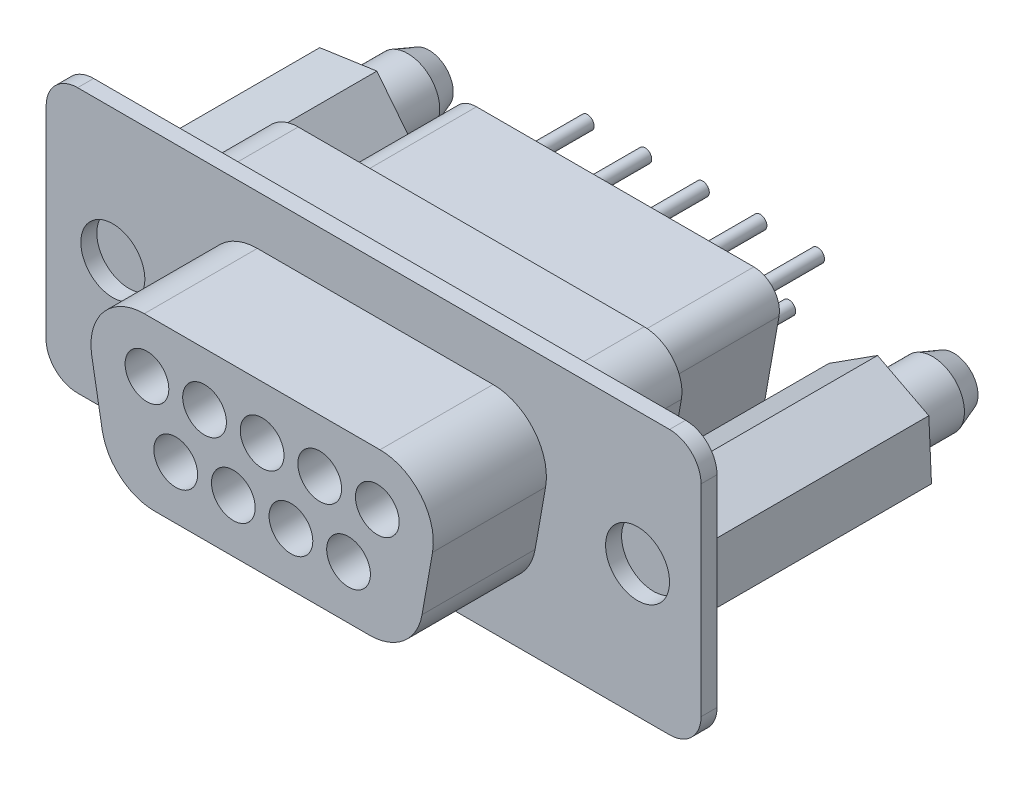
ISO-10303-21;
HEADER;
FILE_DESCRIPTION(('STEP AP214'),'2;1');
FILE_NAME('part.step','',(''),(''),'','','');
FILE_SCHEMA(('AUTOMOTIVE_DESIGN { 1 0 10303 214 1 1 1 1 }'));
ENDSEC;
DATA;
#1=APPLICATION_CONTEXT('core data for automotive mechanical design processes');
#2=APPLICATION_PROTOCOL_DEFINITION('international standard','automotive_design',2000,#1);
#3=PRODUCT_CONTEXT('',#1,'mechanical');
#4=PRODUCT('Part','Part','',(#3));
#5=PRODUCT_RELATED_PRODUCT_CATEGORY('part','',(#4));
#6=PRODUCT_DEFINITION_FORMATION('','',#4);
#7=PRODUCT_DEFINITION_CONTEXT('part definition',#1,'design');
#8=PRODUCT_DEFINITION('design','',#6,#7);
#9=PRODUCT_DEFINITION_SHAPE('','',#8);
#10=(LENGTH_UNIT() NAMED_UNIT(*) SI_UNIT(.MILLI.,.METRE.));
#11=(NAMED_UNIT(*) PLANE_ANGLE_UNIT() SI_UNIT($,.RADIAN.));
#12=(NAMED_UNIT(*) SI_UNIT($,.STERADIAN.) SOLID_ANGLE_UNIT());
#13=UNCERTAINTY_MEASURE_WITH_UNIT(LENGTH_MEASURE(1.E-05),#10,'distance_accuracy_value','');
#14=(GEOMETRIC_REPRESENTATION_CONTEXT(3) GLOBAL_UNCERTAINTY_ASSIGNED_CONTEXT((#13)) GLOBAL_UNIT_ASSIGNED_CONTEXT((#10,
#11,#12)) REPRESENTATION_CONTEXT('',''));
#15=CARTESIAN_POINT('',(0.,0.,0.));
#16=DIRECTION('',(0.,0.,1.));
#17=DIRECTION('',(1.,0.,0.));
#18=AXIS2_PLACEMENT_3D('',#15,#16,#17);
#19=CARTESIAN_POINT('',(0.,0.,-10.795));
#20=DIRECTION('',(0.,0.,-1.));
#21=DIRECTION('',(-1.,0.,0.));
#22=AXIS2_PLACEMENT_3D('',#19,#20,#21);
#23=PLANE('',#22);
#24=DIRECTION('',(-0.842031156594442,-0.539428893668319,0.));
#25=VECTOR('',#24,1.);
#26=CARTESIAN_POINT('',(14.9389523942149,-2.68587157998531,-10.795));
#27=LINE('',#26,#25);
#28=CARTESIAN_POINT('',(14.9389523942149,-2.68587157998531,-10.795));
#29=VERTEX_POINT('',#28);
#30=CARTESIAN_POINT('',(12.6236777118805,-4.16910180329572,-10.795));
#31=VERTEX_POINT('',#30);
#32=EDGE_CURVE('E329',#29,#31,#27,.T.);
#33=ORIENTED_EDGE('',*,*,#32,.T.);
#34=DIRECTION('',(-0.888174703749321,0.459505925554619,0.));
#35=VECTOR('',#34,1.);
#36=CARTESIAN_POINT('',(12.6236777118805,-4.16910180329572,-10.795));
#37=LINE('',#36,#35);
#38=CARTESIAN_POINT('',(10.1815253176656,-2.90563022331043,-10.795));
#39=VERTEX_POINT('',#38);
#40=EDGE_CURVE('E318',#31,#39,#37,.T.);
#41=ORIENTED_EDGE('',*,*,#40,.T.);
#42=DIRECTION('',(-0.046143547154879,0.998934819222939,0.));
#43=VECTOR('',#42,1.);
#44=CARTESIAN_POINT('',(10.1815253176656,-2.90563022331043,-10.795));
#45=LINE('',#44,#43);
#46=CARTESIAN_POINT('',(10.0546476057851,-0.158928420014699,-10.795));
#47=VERTEX_POINT('',#46);
#48=EDGE_CURVE('E328',#39,#47,#45,.T.);
#49=ORIENTED_EDGE('',*,*,#48,.T.);
#50=DIRECTION('',(0.842031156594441,0.539428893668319,0.));
#51=VECTOR('',#50,1.);
#52=CARTESIAN_POINT('',(10.0546476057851,-0.158928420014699,-10.795));
#53=LINE('',#52,#51);
#54=CARTESIAN_POINT('',(12.3699222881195,1.32430180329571,-10.795));
#55=VERTEX_POINT('',#54);
#56=EDGE_CURVE('E1198',#47,#55,#53,.T.);
#57=ORIENTED_EDGE('',*,*,#56,.T.);
#58=DIRECTION('',(0.88817470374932,-0.459505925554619,0.));
#59=VECTOR('',#58,1.);
#60=CARTESIAN_POINT('',(12.3699222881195,1.32430180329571,-10.795));
#61=LINE('',#60,#59);
#62=CARTESIAN_POINT('',(14.8120746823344,0.0608302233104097,-10.795));
#63=VERTEX_POINT('',#62);
#64=EDGE_CURVE('E1201',#55,#63,#61,.T.);
#65=ORIENTED_EDGE('',*,*,#64,.T.);
#66=DIRECTION('',(0.046143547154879,-0.998934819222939,0.));
#67=VECTOR('',#66,1.);
#68=CARTESIAN_POINT('',(14.8120746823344,0.0608302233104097,-10.795));
#69=LINE('',#68,#67);
#70=EDGE_CURVE('E333',#63,#29,#69,.T.);
#71=ORIENTED_EDGE('',*,*,#70,.T.);
#72=EDGE_LOOP('',(#33,#41,#49,#57,#65,#71));
#73=FACE_BOUND('',#72,.T.);
#74=CARTESIAN_POINT('',(12.4968,-1.4224,-10.795));
#75=DIRECTION('',(0.,0.,-1.));
#76=DIRECTION('',(-1.,0.,0.));
#77=AXIS2_PLACEMENT_3D('',#74,#75,#76);
#78=CIRCLE('',#77,1.524);
#79=CARTESIAN_POINT('',(10.9728,-1.4224,-10.795));
#80=VERTEX_POINT('',#79);
#81=EDGE_CURVE('E1208',#80,#80,#78,.T.);
#82=ORIENTED_EDGE('',*,*,#81,.F.);
#83=EDGE_LOOP('',(#82));
#84=FACE_BOUND('',#83,.T.);
#85=ADVANCED_FACE('F36',(#73,#84),#23,.T.);
#86=CARTESIAN_POINT('',(0.,0.,-10.795));
#87=DIRECTION('',(0.,0.,-1.));
#88=DIRECTION('',(-1.,0.,0.));
#89=AXIS2_PLACEMENT_3D('',#86,#87,#88);
#90=PLANE('',#89);
#91=DIRECTION('',(-0.989709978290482,-0.14308794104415,0.));
#92=VECTOR('',#91,1.);
#93=CARTESIAN_POINT('',(-10.7954033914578,-3.5824273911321,-10.795));
#94=LINE('',#93,#92);
#95=CARTESIAN_POINT('',(-10.7954033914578,-3.5824273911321,-10.795));
#96=VERTEX_POINT('',#95);
#97=CARTESIAN_POINT('',(-13.5167402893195,-3.97586638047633,-10.795));
#98=VERTEX_POINT('',#97);
#99=EDGE_CURVE('E352',#96,#98,#94,.T.);
#100=ORIENTED_EDGE('',*,*,#99,.T.);
#101=DIRECTION('',(-0.618772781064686,0.785570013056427,0.));
#102=VECTOR('',#101,1.);
#103=CARTESIAN_POINT('',(-13.5167402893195,-3.97586638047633,-10.795));
#104=LINE('',#103,#102);
#105=CARTESIAN_POINT('',(-15.2181368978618,-1.81583898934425,-10.795));
#106=VERTEX_POINT('',#105);
#107=EDGE_CURVE('E355',#98,#106,#104,.T.);
#108=ORIENTED_EDGE('',*,*,#107,.T.);
#109=DIRECTION('',(0.370937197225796,0.928657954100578,0.));
#110=VECTOR('',#109,1.);
#111=CARTESIAN_POINT('',(-15.2181368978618,-1.81583898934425,-10.795));
#112=LINE('',#111,#110);
#113=CARTESIAN_POINT('',(-14.1981966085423,0.737627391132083,-10.795));
#114=VERTEX_POINT('',#113);
#115=EDGE_CURVE('E358',#106,#114,#112,.T.);
#116=ORIENTED_EDGE('',*,*,#115,.T.);
#117=DIRECTION('',(0.989709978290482,0.14308794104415,0.));
#118=VECTOR('',#117,1.);
#119=CARTESIAN_POINT('',(-14.1981966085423,0.737627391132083,-10.795));
#120=LINE('',#119,#118);
#121=CARTESIAN_POINT('',(-11.4768597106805,1.13106638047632,-10.795));
#122=VERTEX_POINT('',#121);
#123=EDGE_CURVE('E360',#114,#122,#120,.T.);
#124=ORIENTED_EDGE('',*,*,#123,.T.);
#125=DIRECTION('',(0.618772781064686,-0.785570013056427,0.));
#126=VECTOR('',#125,1.);
#127=CARTESIAN_POINT('',(-11.4768597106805,1.13106638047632,-10.795));
#128=LINE('',#127,#126);
#129=CARTESIAN_POINT('',(-9.77546310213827,-1.02896101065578,-10.795));
#130=VERTEX_POINT('',#129);
#131=EDGE_CURVE('E362',#122,#130,#128,.T.);
#132=ORIENTED_EDGE('',*,*,#131,.T.);
#133=DIRECTION('',(-0.370937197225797,-0.928657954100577,0.));
#134=VECTOR('',#133,1.);
#135=CARTESIAN_POINT('',(-9.77546310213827,-1.02896101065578,-10.795));
#136=LINE('',#135,#134);
#137=EDGE_CURVE('E364',#130,#96,#136,.T.);
#138=ORIENTED_EDGE('',*,*,#137,.T.);
#139=EDGE_LOOP('',(#100,#108,#116,#124,#132,#138));
#140=FACE_BOUND('',#139,.T.);
#141=CARTESIAN_POINT('',(-12.4968,-1.42240000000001,-10.795));
#142=DIRECTION('',(0.,0.,-1.));
#143=DIRECTION('',(-1.,0.,0.));
#144=AXIS2_PLACEMENT_3D('',#141,#142,#143);
#145=CIRCLE('',#144,1.524);
#146=CARTESIAN_POINT('',(-14.0208,-1.42240000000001,-10.795));
#147=VERTEX_POINT('',#146);
#148=EDGE_CURVE('E1181',#147,#147,#145,.T.);
#149=ORIENTED_EDGE('',*,*,#148,.F.);
#150=EDGE_LOOP('',(#149));
#151=FACE_BOUND('',#150,.T.);
#152=ADVANCED_FACE('F779',(#140,#151),#90,.T.);
#153=CARTESIAN_POINT('',(5.6134,-0.0126999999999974,0.));
#154=DIRECTION('',(0.,0.,-1.));
#155=DIRECTION('',(-1.,0.,0.));
#156=AXIS2_PLACEMENT_3D('',#153,#154,#155);
#157=PLANE('',#156);
#158=DIRECTION('',(-0.618772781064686,0.785570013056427,0.));
#159=VECTOR('',#158,1.);
#160=CARTESIAN_POINT('',(-13.5167402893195,-3.97586638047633,0.));
#161=LINE('',#160,#159);
#162=CARTESIAN_POINT('',(-13.5167402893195,-3.97586638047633,0.));
#163=VERTEX_POINT('',#162);
#164=CARTESIAN_POINT('',(-15.2181368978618,-1.81583898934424,0.));
#165=VERTEX_POINT('',#164);
#166=EDGE_CURVE('E369',#163,#165,#161,.T.);
#167=ORIENTED_EDGE('',*,*,#166,.F.);
#168=DIRECTION('',(-0.989709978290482,-0.14308794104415,0.));
#169=VECTOR('',#168,1.);
#170=CARTESIAN_POINT('',(-10.7954033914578,-3.58242739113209,0.));
#171=LINE('',#170,#169);
#172=CARTESIAN_POINT('',(-10.7954033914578,-3.58242739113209,0.));
#173=VERTEX_POINT('',#172);
#174=EDGE_CURVE('E346',#173,#163,#171,.T.);
#175=ORIENTED_EDGE('',*,*,#174,.F.);
#176=DIRECTION('',(-0.370937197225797,-0.928657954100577,0.));
#177=VECTOR('',#176,1.);
#178=CARTESIAN_POINT('',(-9.77546310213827,-1.02896101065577,0.));
#179=LINE('',#178,#177);
#180=CARTESIAN_POINT('',(-9.77546310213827,-1.02896101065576,0.));
#181=VERTEX_POINT('',#180);
#182=EDGE_CURVE('E356',#181,#173,#179,.T.);
#183=ORIENTED_EDGE('',*,*,#182,.F.);
#184=DIRECTION('',(0.618772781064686,-0.785570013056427,0.));
#185=VECTOR('',#184,1.);
#186=CARTESIAN_POINT('',(-11.4768597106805,1.13106638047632,0.));
#187=LINE('',#186,#185);
#188=CARTESIAN_POINT('',(-11.4768597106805,1.13106638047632,0.));
#189=VERTEX_POINT('',#188);
#190=EDGE_CURVE('E375',#189,#181,#187,.T.);
#191=ORIENTED_EDGE('',*,*,#190,.F.);
#192=DIRECTION('',(0.989709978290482,0.14308794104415,0.));
#193=VECTOR('',#192,1.);
#194=CARTESIAN_POINT('',(-14.1981966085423,0.73762739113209,0.));
#195=LINE('',#194,#193);
#196=CARTESIAN_POINT('',(-14.1981966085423,0.73762739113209,0.));
#197=VERTEX_POINT('',#196);
#198=EDGE_CURVE('E373',#197,#189,#195,.T.);
#199=ORIENTED_EDGE('',*,*,#198,.F.);
#200=DIRECTION('',(0.370937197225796,0.928657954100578,0.));
#201=VECTOR('',#200,1.);
#202=CARTESIAN_POINT('',(-15.2181368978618,-1.81583898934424,0.));
#203=LINE('',#202,#201);
#204=EDGE_CURVE('E371',#165,#197,#203,.T.);
#205=ORIENTED_EDGE('',*,*,#204,.F.);
#206=EDGE_LOOP('',(#167,#175,#183,#191,#199,#205));
#207=FACE_BOUND('',#206,.T.);
#208=CARTESIAN_POINT('',(-14.1732,3.3782,0.));
#209=DIRECTION('',(0.,0.,-1.));
#210=DIRECTION('',(1.,0.,0.));
#211=AXIS2_PLACEMENT_3D('',#208,#209,#210);
#212=CIRCLE('',#211,1.4986);
#213=CARTESIAN_POINT('',(-15.6718,3.3782,0.));
#214=VERTEX_POINT('',#213);
#215=CARTESIAN_POINT('',(-14.1732,4.8768,0.));
#216=VERTEX_POINT('',#215);
#217=EDGE_CURVE('E550',#214,#216,#212,.T.);
#218=ORIENTED_EDGE('',*,*,#217,.T.);
#219=DIRECTION('',(1.,0.,0.));
#220=VECTOR('',#219,1.);
#221=CARTESIAN_POINT('',(-14.1732,4.8768,0.));
#222=LINE('',#221,#220);
#223=CARTESIAN_POINT('',(14.0208,4.8768,0.));
#224=VERTEX_POINT('',#223);
#225=EDGE_CURVE('E579',#216,#224,#222,.T.);
#226=ORIENTED_EDGE('',*,*,#225,.T.);
#227=CARTESIAN_POINT('',(14.0208,3.3782,0.));
#228=DIRECTION('',(0.,0.,-1.));
#229=DIRECTION('',(-1.,0.,0.));
#230=AXIS2_PLACEMENT_3D('',#227,#228,#229);
#231=CIRCLE('',#230,1.4986);
#232=CARTESIAN_POINT('',(15.5194,3.3782,0.));
#233=VERTEX_POINT('',#232);
#234=EDGE_CURVE('E582',#224,#233,#231,.T.);
#235=ORIENTED_EDGE('',*,*,#234,.T.);
#236=DIRECTION('',(0.,-1.,0.));
#237=VECTOR('',#236,1.);
#238=CARTESIAN_POINT('',(15.5194,3.3782,0.));
#239=LINE('',#238,#237);
#240=CARTESIAN_POINT('',(15.5194,-6.22300000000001,0.));
#241=VERTEX_POINT('',#240);
#242=EDGE_CURVE('E585',#233,#241,#239,.T.);
#243=ORIENTED_EDGE('',*,*,#242,.T.);
#244=CARTESIAN_POINT('',(14.0208,-6.22300000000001,0.));
#245=DIRECTION('',(0.,0.,-1.));
#246=DIRECTION('',(1.,0.,0.));
#247=AXIS2_PLACEMENT_3D('',#244,#245,#246);
#248=CIRCLE('',#247,1.4986);
#249=CARTESIAN_POINT('',(14.0208,-7.7216,0.));
#250=VERTEX_POINT('',#249);
#251=EDGE_CURVE('E588',#241,#250,#248,.T.);
#252=ORIENTED_EDGE('',*,*,#251,.T.);
#253=DIRECTION('',(-1.,0.,0.));
#254=VECTOR('',#253,1.);
#255=CARTESIAN_POINT('',(-14.1809692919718,-7.7216,0.));
#256=LINE('',#255,#254);
#257=CARTESIAN_POINT('',(-14.1809692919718,-7.7216,0.));
#258=VERTEX_POINT('',#257);
#259=EDGE_CURVE('E591',#250,#258,#256,.T.);
#260=ORIENTED_EDGE('',*,*,#259,.T.);
#261=CARTESIAN_POINT('',(-14.1809692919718,-6.22300000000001,0.));
#262=DIRECTION('',(0.,0.,-1.));
#263=DIRECTION('',(1.,0.,0.));
#264=AXIS2_PLACEMENT_3D('',#261,#262,#263);
#265=CIRCLE('',#264,1.4986);
#266=CARTESIAN_POINT('',(-15.6718,-6.07059999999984,0.));
#267=VERTEX_POINT('',#266);
#268=EDGE_CURVE('E594',#258,#267,#265,.T.);
#269=ORIENTED_EDGE('',*,*,#268,.T.);
#270=DIRECTION('',(0.,1.,0.));
#271=VECTOR('',#270,1.);
#272=CARTESIAN_POINT('',(-15.6718,3.3782,0.));
#273=LINE('',#272,#271);
#274=EDGE_CURVE('E555',#267,#214,#273,.T.);
#275=ORIENTED_EDGE('',*,*,#274,.T.);
#276=EDGE_LOOP('',(#218,#226,#235,#243,#252,#260,#269,#275));
#277=FACE_BOUND('',#276,.T.);
#278=DIRECTION('',(1.,0.,0.));
#279=VECTOR('',#278,1.);
#280=CARTESIAN_POINT('',(8.23909386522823,3.93700000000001,0.));
#281=LINE('',#280,#279);
#282=CARTESIAN_POINT('',(-8.23909386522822,3.937,0.));
#283=VERTEX_POINT('',#282);
#284=CARTESIAN_POINT('',(8.23909386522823,3.93700000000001,0.));
#285=VERTEX_POINT('',#284);
#286=EDGE_CURVE('E509',#283,#285,#281,.T.);
#287=ORIENTED_EDGE('',*,*,#286,.F.);
#288=CARTESIAN_POINT('',(-8.23909386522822,2.13872517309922,0.));
#289=DIRECTION('',(0.,0.,-1.));
#290=DIRECTION('',(1.,0.,0.));
#291=AXIS2_PLACEMENT_3D('',#288,#289,#290);
#292=CIRCLE('',#291,1.79827482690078);
#293=CARTESIAN_POINT('',(-10.0100488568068,1.82645802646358,0.));
#294=VERTEX_POINT('',#293);
#295=EDGE_CURVE('E487',#294,#283,#292,.T.);
#296=ORIENTED_EDGE('',*,*,#295,.F.);
#297=DIRECTION('',(-0.173648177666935,0.984807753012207,0.));
#298=VECTOR('',#297,1.);
#299=CARTESIAN_POINT('',(-10.0100488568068,1.82645802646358,0.));
#300=LINE('',#299,#298);
#301=CARTESIAN_POINT('',(-8.77320359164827,-5.18804003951,0.));
#302=VERTEX_POINT('',#301);
#303=EDGE_CURVE('E492',#302,#294,#300,.T.);
#304=ORIENTED_EDGE('',*,*,#303,.F.);
#305=CARTESIAN_POINT('',(-6.84961799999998,-4.84886000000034,0.));
#306=DIRECTION('',(0.,0.,-1.));
#307=DIRECTION('',(1.,0.,0.));
#308=AXIS2_PLACEMENT_3D('',#305,#306,#307);
#309=CIRCLE('',#308,1.95325999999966);
#310=CARTESIAN_POINT('',(-6.84961799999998,-6.80212,0.));
#311=VERTEX_POINT('',#310);
#312=EDGE_CURVE('E519',#311,#302,#309,.T.);
#313=ORIENTED_EDGE('',*,*,#312,.F.);
#314=DIRECTION('',(-1.,0.,0.));
#315=VECTOR('',#314,1.);
#316=CARTESIAN_POINT('',(-6.84961799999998,-6.80212,0.));
#317=LINE('',#316,#315);
#318=CARTESIAN_POINT('',(6.84961799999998,-6.80212,0.));
#319=VERTEX_POINT('',#318);
#320=EDGE_CURVE('E517',#319,#311,#317,.T.);
#321=ORIENTED_EDGE('',*,*,#320,.F.);
#322=CARTESIAN_POINT('',(6.84961799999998,-4.84886000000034,0.));
#323=DIRECTION('',(0.,0.,-1.));
#324=DIRECTION('',(1.,0.,0.));
#325=AXIS2_PLACEMENT_3D('',#322,#323,#324);
#326=CIRCLE('',#325,1.95325999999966);
#327=CARTESIAN_POINT('',(8.77320359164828,-5.18804003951,0.));
#328=VERTEX_POINT('',#327);
#329=EDGE_CURVE('E515',#328,#319,#326,.T.);
#330=ORIENTED_EDGE('',*,*,#329,.F.);
#331=DIRECTION('',(-0.173648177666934,-0.984807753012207,0.));
#332=VECTOR('',#331,1.);
#333=CARTESIAN_POINT('',(8.77320359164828,-5.18804003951,0.));
#334=LINE('',#333,#332);
#335=CARTESIAN_POINT('',(10.0100488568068,1.82645802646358,0.));
#336=VERTEX_POINT('',#335);
#337=EDGE_CURVE('E513',#336,#328,#334,.T.);
#338=ORIENTED_EDGE('',*,*,#337,.F.);
#339=CARTESIAN_POINT('',(8.23909386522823,2.13872517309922,0.));
#340=DIRECTION('',(0.,0.,-1.));
#341=DIRECTION('',(1.,0.,0.));
#342=AXIS2_PLACEMENT_3D('',#339,#340,#341);
#343=CIRCLE('',#342,1.79827482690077);
#344=EDGE_CURVE('E511',#285,#336,#343,.T.);
#345=ORIENTED_EDGE('',*,*,#344,.F.);
#346=EDGE_LOOP('',(#287,#296,#304,#313,#321,#330,#338,#345));
#347=FACE_BOUND('',#346,.T.);
#348=DIRECTION('',(-0.888174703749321,0.459505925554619,0.));
#349=VECTOR('',#348,1.);
#350=CARTESIAN_POINT('',(12.6236777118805,-4.16910180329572,0.));
#351=LINE('',#350,#349);
#352=CARTESIAN_POINT('',(12.6236777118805,-4.16910180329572,0.));
#353=VERTEX_POINT('',#352);
#354=CARTESIAN_POINT('',(10.1815253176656,-2.90563022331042,0.));
#355=VERTEX_POINT('',#354);
#356=EDGE_CURVE('E1174',#353,#355,#351,.T.);
#357=ORIENTED_EDGE('',*,*,#356,.F.);
#358=DIRECTION('',(-0.842031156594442,-0.539428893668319,0.));
#359=VECTOR('',#358,1.);
#360=CARTESIAN_POINT('',(14.9389523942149,-2.6858715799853,0.));
#361=LINE('',#360,#359);
#362=CARTESIAN_POINT('',(14.9389523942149,-2.6858715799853,0.));
#363=VERTEX_POINT('',#362);
#364=EDGE_CURVE('E341',#363,#353,#361,.T.);
#365=ORIENTED_EDGE('',*,*,#364,.F.);
#366=DIRECTION('',(0.046143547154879,-0.998934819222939,0.));
#367=VECTOR('',#366,1.);
#368=CARTESIAN_POINT('',(14.8120746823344,0.0608302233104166,0.));
#369=LINE('',#368,#367);
#370=CARTESIAN_POINT('',(14.8120746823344,0.0608302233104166,0.));
#371=VERTEX_POINT('',#370);
#372=EDGE_CURVE('E337',#371,#363,#369,.T.);
#373=ORIENTED_EDGE('',*,*,#372,.F.);
#374=DIRECTION('',(0.88817470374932,-0.459505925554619,0.));
#375=VECTOR('',#374,1.);
#376=CARTESIAN_POINT('',(12.3699222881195,1.32430180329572,0.));
#377=LINE('',#376,#375);
#378=CARTESIAN_POINT('',(12.3699222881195,1.32430180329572,0.));
#379=VERTEX_POINT('',#378);
#380=EDGE_CURVE('E1186',#379,#371,#377,.T.);
#381=ORIENTED_EDGE('',*,*,#380,.F.);
#382=DIRECTION('',(0.842031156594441,0.539428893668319,0.));
#383=VECTOR('',#382,1.);
#384=CARTESIAN_POINT('',(10.0546476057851,-0.158928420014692,0.));
#385=LINE('',#384,#383);
#386=CARTESIAN_POINT('',(10.0546476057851,-0.158928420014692,0.));
#387=VERTEX_POINT('',#386);
#388=EDGE_CURVE('E1179',#387,#379,#385,.T.);
#389=ORIENTED_EDGE('',*,*,#388,.F.);
#390=DIRECTION('',(-0.046143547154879,0.998934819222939,0.));
#391=VECTOR('',#390,1.);
#392=CARTESIAN_POINT('',(10.1815253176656,-2.90563022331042,0.));
#393=LINE('',#392,#391);
#394=EDGE_CURVE('E1177',#355,#387,#393,.T.);
#395=ORIENTED_EDGE('',*,*,#394,.F.);
#396=EDGE_LOOP('',(#357,#365,#373,#381,#389,#395));
#397=FACE_BOUND('',#396,.T.);
#398=ADVANCED_FACE('F784',(#207,#277,#347,#397),#157,.T.);
#399=CARTESIAN_POINT('',(-6.604,0.939799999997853,-10.6680000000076));
#400=DIRECTION('',(0.,0.,1.));
#401=DIRECTION('',(1.,0.,0.));
#402=AXIS2_PLACEMENT_3D('',#399,#400,#401);
#403=PLANE('',#402);
#404=CARTESIAN_POINT('',(-1.37160000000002,-2.84480000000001,-10.6680000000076));
#405=DIRECTION('',(0.,0.,1.));
#406=DIRECTION('',(1.,0.,0.));
#407=AXIS2_PLACEMENT_3D('',#404,#405,#406);
#408=CIRCLE('',#407,0.3175);
#409=CARTESIAN_POINT('',(-1.05410000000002,-2.84480000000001,-10.6680000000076));
#410=VERTEX_POINT('',#409);
#411=EDGE_CURVE('E754',#410,#410,#408,.F.);
#412=ORIENTED_EDGE('',*,*,#411,.F.);
#413=EDGE_LOOP('',(#412));
#414=FACE_BOUND('',#413,.T.);
#415=CARTESIAN_POINT('',(4.11479999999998,-2.84480000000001,-10.6680000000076));
#416=DIRECTION('',(0.,0.,1.));
#417=DIRECTION('',(1.,0.,0.));
#418=AXIS2_PLACEMENT_3D('',#415,#416,#417);
#419=CIRCLE('',#418,0.3175);
#420=CARTESIAN_POINT('',(4.43229999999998,-2.84480000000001,-10.6680000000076));
#421=VERTEX_POINT('',#420);
#422=EDGE_CURVE('E748',#421,#421,#419,.F.);
#423=ORIENTED_EDGE('',*,*,#422,.F.);
#424=EDGE_LOOP('',(#423));
#425=FACE_BOUND('',#424,.T.);
#426=CARTESIAN_POINT('',(2.7432,0.,-10.6680000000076));
#427=DIRECTION('',(0.,0.,1.));
#428=DIRECTION('',(1.,0.,0.));
#429=AXIS2_PLACEMENT_3D('',#426,#427,#428);
#430=CIRCLE('',#429,0.3175);
#431=CARTESIAN_POINT('',(3.0607,0.,-10.6680000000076));
#432=VERTEX_POINT('',#431);
#433=EDGE_CURVE('E742',#432,#432,#430,.F.);
#434=ORIENTED_EDGE('',*,*,#433,.F.);
#435=EDGE_LOOP('',(#434));
#436=FACE_BOUND('',#435,.T.);
#437=CARTESIAN_POINT('',(-2.7432,0.,-10.6680000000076));
#438=DIRECTION('',(0.,0.,1.));
#439=DIRECTION('',(1.,0.,0.));
#440=AXIS2_PLACEMENT_3D('',#437,#438,#439);
#441=CIRCLE('',#440,0.3175);
#442=CARTESIAN_POINT('',(-2.4257,0.,-10.6680000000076));
#443=VERTEX_POINT('',#442);
#444=EDGE_CURVE('E736',#443,#443,#441,.F.);
#445=ORIENTED_EDGE('',*,*,#444,.F.);
#446=EDGE_LOOP('',(#445));
#447=FACE_BOUND('',#446,.T.);
#448=CARTESIAN_POINT('',(-6.604,0.939799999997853,-10.6680000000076));
#449=DIRECTION('',(0.,0.,-1.));
#450=DIRECTION('',(1.,0.,0.));
#451=AXIS2_PLACEMENT_3D('',#448,#449,#450);
#452=CIRCLE('',#451,1.21920000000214);
#453=CARTESIAN_POINT('',(-7.80467761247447,0.728088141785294,-10.6680000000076));
#454=VERTEX_POINT('',#453);
#455=CARTESIAN_POINT('',(-6.604,2.15899999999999,-10.6680000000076));
#456=VERTEX_POINT('',#455);
#457=EDGE_CURVE('E423',#454,#456,#452,.T.);
#458=ORIENTED_EDGE('',*,*,#457,.T.);
#459=DIRECTION('',(1.,0.,0.));
#460=VECTOR('',#459,1.);
#461=CARTESIAN_POINT('',(-6.604,2.15899999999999,-10.6680000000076));
#462=LINE('',#461,#460);
#463=CARTESIAN_POINT('',(6.604,2.15899999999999,-10.6680000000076));
#464=VERTEX_POINT('',#463);
#465=EDGE_CURVE('E426',#456,#464,#462,.T.);
#466=ORIENTED_EDGE('',*,*,#465,.T.);
#467=CARTESIAN_POINT('',(6.604,0.93979999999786,-10.6680000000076));
#468=DIRECTION('',(0.,0.,-1.));
#469=DIRECTION('',(-1.,0.,0.));
#470=AXIS2_PLACEMENT_3D('',#467,#468,#469);
#471=CIRCLE('',#470,1.21920000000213);
#472=CARTESIAN_POINT('',(7.80445268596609,0.726816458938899,-10.6680000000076));
#473=VERTEX_POINT('',#472);
#474=EDGE_CURVE('E429',#464,#473,#471,.T.);
#475=ORIENTED_EDGE('',*,*,#474,.T.);
#476=DIRECTION('',(-0.174691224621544,-0.984623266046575,0.));
#477=VECTOR('',#476,1.);
#478=CARTESIAN_POINT('',(7.80445268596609,0.726816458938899,-10.6680000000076));
#479=LINE('',#478,#477);
#480=CARTESIAN_POINT('',(6.9662526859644,-3.99758354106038,-10.6680000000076));
#481=VERTEX_POINT('',#480);
#482=EDGE_CURVE('E431',#473,#481,#479,.T.);
#483=ORIENTED_EDGE('',*,*,#482,.T.);
#484=CARTESIAN_POINT('',(5.7658,-3.78460000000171,-10.6680000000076));
#485=DIRECTION('',(0.,0.,-1.));
#486=DIRECTION('',(1.,0.,0.));
#487=AXIS2_PLACEMENT_3D('',#484,#485,#486);
#488=CIRCLE('',#487,1.21920000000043);
#489=CARTESIAN_POINT('',(5.7658,-5.00380000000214,-10.6680000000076));
#490=VERTEX_POINT('',#489);
#491=EDGE_CURVE('E433',#481,#490,#488,.T.);
#492=ORIENTED_EDGE('',*,*,#491,.T.);
#493=DIRECTION('',(-1.,0.,0.));
#494=VECTOR('',#493,1.);
#495=CARTESIAN_POINT('',(-5.77096081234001,-5.00380000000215,-10.6680000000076));
#496=LINE('',#495,#494);
#497=CARTESIAN_POINT('',(-5.77096081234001,-5.00380000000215,-10.6680000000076));
#498=VERTEX_POINT('',#497);
#499=EDGE_CURVE('E435',#490,#498,#496,.T.);
#500=ORIENTED_EDGE('',*,*,#499,.T.);
#501=CARTESIAN_POINT('',(-5.77096081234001,-3.78460000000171,-10.6680000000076));
#502=DIRECTION('',(0.,0.,-1.));
#503=DIRECTION('',(1.,0.,0.));
#504=AXIS2_PLACEMENT_3D('',#501,#502,#503);
#505=CIRCLE('',#504,1.21920000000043);
#506=CARTESIAN_POINT('',(-6.9716384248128,-3.99631185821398,-10.6680000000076));
#507=VERTEX_POINT('',#506);
#508=EDGE_CURVE('E437',#498,#507,#505,.T.);
#509=ORIENTED_EDGE('',*,*,#508,.T.);
#510=DIRECTION('',(-0.173648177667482,0.984807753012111,0.));
#511=VECTOR('',#510,1.);
#512=CARTESIAN_POINT('',(-7.80467761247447,0.728088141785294,-10.6680000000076));
#513=LINE('',#512,#511);
#514=EDGE_CURVE('E439',#507,#454,#513,.T.);
#515=ORIENTED_EDGE('',*,*,#514,.T.);
#516=EDGE_LOOP('',(#458,#466,#475,#483,#492,#500,#509,#515));
#517=FACE_BOUND('',#516,.T.);
#518=CARTESIAN_POINT('',(-5.4864,0.,-10.6680000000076));
#519=DIRECTION('',(0.,0.,1.));
#520=DIRECTION('',(1.,0.,0.));
#521=AXIS2_PLACEMENT_3D('',#518,#519,#520);
#522=CIRCLE('',#521,0.3175);
#523=CARTESIAN_POINT('',(-5.1689,0.,-10.6680000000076));
#524=VERTEX_POINT('',#523);
#525=EDGE_CURVE('E640',#524,#524,#522,.F.);
#526=ORIENTED_EDGE('',*,*,#525,.F.);
#527=EDGE_LOOP('',(#526));
#528=FACE_BOUND('',#527,.T.);
#529=CARTESIAN_POINT('',(0.,0.,-10.6680000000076));
#530=DIRECTION('',(0.,0.,1.));
#531=DIRECTION('',(1.,0.,0.));
#532=AXIS2_PLACEMENT_3D('',#529,#530,#531);
#533=CIRCLE('',#532,0.3175);
#534=CARTESIAN_POINT('',(0.3175,0.,-10.6680000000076));
#535=VERTEX_POINT('',#534);
#536=EDGE_CURVE('E739',#535,#535,#533,.F.);
#537=ORIENTED_EDGE('',*,*,#536,.F.);
#538=EDGE_LOOP('',(#537));
#539=FACE_BOUND('',#538,.T.);
#540=CARTESIAN_POINT('',(5.4864,0.,-10.6680000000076));
#541=DIRECTION('',(0.,0.,1.));
#542=DIRECTION('',(1.,0.,0.));
#543=AXIS2_PLACEMENT_3D('',#540,#541,#542);
#544=CIRCLE('',#543,0.3175);
#545=CARTESIAN_POINT('',(5.8039,0.,-10.6680000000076));
#546=VERTEX_POINT('',#545);
#547=EDGE_CURVE('E745',#546,#546,#544,.F.);
#548=ORIENTED_EDGE('',*,*,#547,.F.);
#549=EDGE_LOOP('',(#548));
#550=FACE_BOUND('',#549,.T.);
#551=CARTESIAN_POINT('',(1.37159999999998,-2.84480000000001,-10.6680000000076));
#552=DIRECTION('',(0.,0.,1.));
#553=DIRECTION('',(1.,0.,0.));
#554=AXIS2_PLACEMENT_3D('',#551,#552,#553);
#555=CIRCLE('',#554,0.3175);
#556=CARTESIAN_POINT('',(1.68909999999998,-2.84480000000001,-10.6680000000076));
#557=VERTEX_POINT('',#556);
#558=EDGE_CURVE('E751',#557,#557,#555,.F.);
#559=ORIENTED_EDGE('',*,*,#558,.F.);
#560=EDGE_LOOP('',(#559));
#561=FACE_BOUND('',#560,.T.);
#562=CARTESIAN_POINT('',(-4.11480000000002,-2.84480000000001,-10.6680000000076));
#563=DIRECTION('',(0.,0.,1.));
#564=DIRECTION('',(1.,0.,0.));
#565=AXIS2_PLACEMENT_3D('',#562,#563,#564);
#566=CIRCLE('',#565,0.3175);
#567=CARTESIAN_POINT('',(-3.79730000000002,-2.84480000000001,-10.6680000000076));
#568=VERTEX_POINT('',#567);
#569=EDGE_CURVE('E757',#568,#568,#566,.F.);
#570=ORIENTED_EDGE('',*,*,#569,.F.);
#571=EDGE_LOOP('',(#570));
#572=FACE_BOUND('',#571,.T.);
#573=ADVANCED_FACE('F914',(#414,#425,#436,#447,#517,#528,#539,#550,#561,#572),#403,.F.);
#574=CARTESIAN_POINT('',(-8.23909386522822,2.13872517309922,-3.81000000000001));
#575=DIRECTION('',(0.,0.,1.));
#576=DIRECTION('',(1.,0.,0.));
#577=AXIS2_PLACEMENT_3D('',#574,#575,#576);
#578=PLANE('',#577);
#579=CARTESIAN_POINT('',(-8.23909386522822,2.13872517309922,-3.81000000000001));
#580=DIRECTION('',(0.,0.,-1.));
#581=DIRECTION('',(1.,0.,0.));
#582=AXIS2_PLACEMENT_3D('',#579,#580,#581);
#583=CIRCLE('',#582,1.79827482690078);
#584=CARTESIAN_POINT('',(-10.0100488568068,1.82645802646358,-3.81000000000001));
#585=VERTEX_POINT('',#584);
#586=CARTESIAN_POINT('',(-8.23909386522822,3.93699999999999,-3.81000000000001));
#587=VERTEX_POINT('',#586);
#588=EDGE_CURVE('E488',#585,#587,#583,.T.);
#589=ORIENTED_EDGE('',*,*,#588,.T.);
#590=DIRECTION('',(1.,0.,0.));
#591=VECTOR('',#590,1.);
#592=CARTESIAN_POINT('',(8.23909386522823,3.937,-3.81000000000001));
#593=LINE('',#592,#591);
#594=CARTESIAN_POINT('',(8.23909386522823,3.937,-3.81000000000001));
#595=VERTEX_POINT('',#594);
#596=EDGE_CURVE('E491',#587,#595,#593,.T.);
#597=ORIENTED_EDGE('',*,*,#596,.T.);
#598=CARTESIAN_POINT('',(8.23909386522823,2.13872517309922,-3.81000000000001));
#599=DIRECTION('',(0.,0.,-1.));
#600=DIRECTION('',(1.,0.,0.));
#601=AXIS2_PLACEMENT_3D('',#598,#599,#600);
#602=CIRCLE('',#601,1.79827482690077);
#603=CARTESIAN_POINT('',(10.0100488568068,1.82645802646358,-3.81000000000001));
#604=VERTEX_POINT('',#603);
#605=EDGE_CURVE('E494',#595,#604,#602,.T.);
#606=ORIENTED_EDGE('',*,*,#605,.T.);
#607=DIRECTION('',(-0.173648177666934,-0.984807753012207,0.));
#608=VECTOR('',#607,1.);
#609=CARTESIAN_POINT('',(8.77320359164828,-5.18804003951,-3.81000000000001));
#610=LINE('',#609,#608);
#611=CARTESIAN_POINT('',(8.77320359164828,-5.18804003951,-3.81000000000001));
#612=VERTEX_POINT('',#611);
#613=EDGE_CURVE('E496',#604,#612,#610,.T.);
#614=ORIENTED_EDGE('',*,*,#613,.T.);
#615=CARTESIAN_POINT('',(6.84961799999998,-4.84886000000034,-3.81000000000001));
#616=DIRECTION('',(0.,0.,-1.));
#617=DIRECTION('',(1.,0.,0.));
#618=AXIS2_PLACEMENT_3D('',#615,#616,#617);
#619=CIRCLE('',#618,1.95325999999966);
#620=CARTESIAN_POINT('',(6.84961799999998,-6.80212,-3.81000000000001));
#621=VERTEX_POINT('',#620);
#622=EDGE_CURVE('E498',#612,#621,#619,.T.);
#623=ORIENTED_EDGE('',*,*,#622,.T.);
#624=DIRECTION('',(-1.,0.,0.));
#625=VECTOR('',#624,1.);
#626=CARTESIAN_POINT('',(-6.84961799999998,-6.80212,-3.81000000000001));
#627=LINE('',#626,#625);
#628=CARTESIAN_POINT('',(-6.84961799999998,-6.80212,-3.81000000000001));
#629=VERTEX_POINT('',#628);
#630=EDGE_CURVE('E500',#621,#629,#627,.T.);
#631=ORIENTED_EDGE('',*,*,#630,.T.);
#632=CARTESIAN_POINT('',(-6.84961799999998,-4.84886000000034,-3.81000000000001));
#633=DIRECTION('',(0.,0.,-1.));
#634=DIRECTION('',(1.,0.,0.));
#635=AXIS2_PLACEMENT_3D('',#632,#633,#634);
#636=CIRCLE('',#635,1.95325999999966);
#637=CARTESIAN_POINT('',(-8.77320359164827,-5.18804003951,-3.81000000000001));
#638=VERTEX_POINT('',#637);
#639=EDGE_CURVE('E502',#629,#638,#636,.T.);
#640=ORIENTED_EDGE('',*,*,#639,.T.);
#641=DIRECTION('',(-0.173648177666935,0.984807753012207,0.));
#642=VECTOR('',#641,1.);
#643=CARTESIAN_POINT('',(-10.0100488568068,1.82645802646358,-3.81000000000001));
#644=LINE('',#643,#642);
#645=EDGE_CURVE('E504',#638,#585,#644,.T.);
#646=ORIENTED_EDGE('',*,*,#645,.T.);
#647=EDGE_LOOP('',(#589,#597,#606,#614,#623,#631,#640,#646));
#648=FACE_BOUND('',#647,.T.);
#649=CARTESIAN_POINT('',(-6.604,0.93979999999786,-3.81000000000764));
#650=DIRECTION('',(0.,0.,-1.));
#651=DIRECTION('',(1.,0.,0.));
#652=AXIS2_PLACEMENT_3D('',#649,#650,#651);
#653=CIRCLE('',#652,1.21920000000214);
#654=CARTESIAN_POINT('',(-7.80467761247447,0.7280881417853,-3.81000000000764));
#655=VERTEX_POINT('',#654);
#656=CARTESIAN_POINT('',(-6.604,2.159,-3.81000000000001));
#657=VERTEX_POINT('',#656);
#658=EDGE_CURVE('E422',#655,#657,#653,.T.);
#659=ORIENTED_EDGE('',*,*,#658,.F.);
#660=DIRECTION('',(-0.173648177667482,0.984807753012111,0.));
#661=VECTOR('',#660,1.);
#662=CARTESIAN_POINT('',(-7.80467761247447,0.7280881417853,-3.81000000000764));
#663=LINE('',#662,#661);
#664=CARTESIAN_POINT('',(-6.97163842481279,-3.99631185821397,-3.81000000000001));
#665=VERTEX_POINT('',#664);
#666=EDGE_CURVE('E427',#665,#655,#663,.T.);
#667=ORIENTED_EDGE('',*,*,#666,.F.);
#668=CARTESIAN_POINT('',(-5.77096081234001,-3.78460000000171,-3.81000000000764));
#669=DIRECTION('',(0.,0.,-1.));
#670=DIRECTION('',(1.,0.,0.));
#671=AXIS2_PLACEMENT_3D('',#668,#669,#670);
#672=CIRCLE('',#671,1.21920000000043);
#673=CARTESIAN_POINT('',(-5.77096081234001,-5.00380000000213,-3.81000000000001));
#674=VERTEX_POINT('',#673);
#675=EDGE_CURVE('E459',#674,#665,#672,.T.);
#676=ORIENTED_EDGE('',*,*,#675,.F.);
#677=DIRECTION('',(-1.,0.,0.));
#678=VECTOR('',#677,1.);
#679=CARTESIAN_POINT('',(-5.77096081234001,-5.00380000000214,-3.81000000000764));
#680=LINE('',#679,#678);
#681=CARTESIAN_POINT('',(5.7658,-5.00380000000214,-3.81000000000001));
#682=VERTEX_POINT('',#681);
#683=EDGE_CURVE('E456',#682,#674,#680,.T.);
#684=ORIENTED_EDGE('',*,*,#683,.F.);
#685=CARTESIAN_POINT('',(5.7658,-3.78460000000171,-3.81000000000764));
#686=DIRECTION('',(0.,0.,-1.));
#687=DIRECTION('',(1.,0.,0.));
#688=AXIS2_PLACEMENT_3D('',#685,#686,#687);
#689=CIRCLE('',#688,1.21920000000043);
#690=CARTESIAN_POINT('',(6.96625268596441,-3.99758354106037,-3.81000000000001));
#691=VERTEX_POINT('',#690);
#692=EDGE_CURVE('E453',#691,#682,#689,.T.);
#693=ORIENTED_EDGE('',*,*,#692,.F.);
#694=DIRECTION('',(-0.174691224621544,-0.984623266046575,0.));
#695=VECTOR('',#694,1.);
#696=CARTESIAN_POINT('',(7.80445268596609,0.726816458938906,-3.81000000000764));
#697=LINE('',#696,#695);
#698=CARTESIAN_POINT('',(7.80445268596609,0.726816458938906,-3.81000000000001));
#699=VERTEX_POINT('',#698);
#700=EDGE_CURVE('E450',#699,#691,#697,.T.);
#701=ORIENTED_EDGE('',*,*,#700,.F.);
#702=CARTESIAN_POINT('',(6.604,0.939799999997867,-3.81000000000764));
#703=DIRECTION('',(0.,0.,-1.));
#704=DIRECTION('',(-1.,0.,0.));
#705=AXIS2_PLACEMENT_3D('',#702,#703,#704);
#706=CIRCLE('',#705,1.21920000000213);
#707=CARTESIAN_POINT('',(6.604,2.159,-3.81000000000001));
#708=VERTEX_POINT('',#707);
#709=EDGE_CURVE('E447',#708,#699,#706,.T.);
#710=ORIENTED_EDGE('',*,*,#709,.F.);
#711=DIRECTION('',(1.,0.,0.));
#712=VECTOR('',#711,1.);
#713=CARTESIAN_POINT('',(-6.604,2.159,-3.81000000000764));
#714=LINE('',#713,#712);
#715=EDGE_CURVE('E444',#657,#708,#714,.T.);
#716=ORIENTED_EDGE('',*,*,#715,.F.);
#717=EDGE_LOOP('',(#659,#667,#676,#684,#693,#701,#710,#716));
#718=FACE_BOUND('',#717,.T.);
#719=ADVANCED_FACE('F917',(#648,#718),#578,.F.);
#720=CARTESIAN_POINT('',(5.6134,-0.0126999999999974,6.14680000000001));
#721=DIRECTION('',(0.,0.,-1.));
#722=DIRECTION('',(-1.,0.,0.));
#723=AXIS2_PLACEMENT_3D('',#720,#721,#722);
#724=PLANE('',#723);
#725=CARTESIAN_POINT('',(1.37159999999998,-2.8448,6.14680000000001));
#726=DIRECTION('',(0.,0.,1.));
#727=DIRECTION('',(1.,0.,0.));
#728=AXIS2_PLACEMENT_3D('',#725,#726,#727);
#729=CIRCLE('',#728,1.0414);
#730=CARTESIAN_POINT('',(2.41299999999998,-2.8448,6.14680000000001));
#731=VERTEX_POINT('',#730);
#732=EDGE_CURVE('E667',#731,#731,#729,.T.);
#733=ORIENTED_EDGE('',*,*,#732,.F.);
#734=EDGE_LOOP('',(#733));
#735=FACE_BOUND('',#734,.T.);
#736=CARTESIAN_POINT('',(-4.11480000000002,-2.8448,6.14680000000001));
#737=DIRECTION('',(0.,0.,1.));
#738=DIRECTION('',(1.,0.,0.));
#739=AXIS2_PLACEMENT_3D('',#736,#737,#738);
#740=CIRCLE('',#739,1.04139999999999);
#741=CARTESIAN_POINT('',(-3.07340000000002,-2.8448,6.14680000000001));
#742=VERTEX_POINT('',#741);
#743=EDGE_CURVE('E673',#742,#742,#740,.T.);
#744=ORIENTED_EDGE('',*,*,#743,.F.);
#745=EDGE_LOOP('',(#744));
#746=FACE_BOUND('',#745,.T.);
#747=CARTESIAN_POINT('',(-2.7432,0.,6.14680000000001));
#748=DIRECTION('',(0.,0.,1.));
#749=DIRECTION('',(1.,0.,0.));
#750=AXIS2_PLACEMENT_3D('',#747,#748,#749);
#751=CIRCLE('',#750,1.0414);
#752=CARTESIAN_POINT('',(-1.70180000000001,0.,6.14680000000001));
#753=VERTEX_POINT('',#752);
#754=EDGE_CURVE('E679',#753,#753,#751,.T.);
#755=ORIENTED_EDGE('',*,*,#754,.F.);
#756=EDGE_LOOP('',(#755));
#757=FACE_BOUND('',#756,.T.);
#758=CARTESIAN_POINT('',(2.7432,0.,6.14680000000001));
#759=DIRECTION('',(0.,0.,1.));
#760=DIRECTION('',(1.,0.,0.));
#761=AXIS2_PLACEMENT_3D('',#758,#759,#760);
#762=CIRCLE('',#761,1.0414);
#763=CARTESIAN_POINT('',(3.7846,0.,6.14680000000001));
#764=VERTEX_POINT('',#763);
#765=EDGE_CURVE('E685',#764,#764,#762,.T.);
#766=ORIENTED_EDGE('',*,*,#765,.F.);
#767=EDGE_LOOP('',(#766));
#768=FACE_BOUND('',#767,.T.);
#769=CARTESIAN_POINT('',(5.6134,-0.0126999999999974,6.14680000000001));
#770=DIRECTION('',(0.,0.,1.));
#771=DIRECTION('',(-1.,0.,0.));
#772=AXIS2_PLACEMENT_3D('',#769,#770,#771);
#773=CIRCLE('',#772,2.54);
#774=CARTESIAN_POINT('',(8.11481169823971,-0.453766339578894,6.14680000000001));
#775=VERTEX_POINT('',#774);
#776=CARTESIAN_POINT('',(5.6134,2.5273,6.14680000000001));
#777=VERTEX_POINT('',#776);
#778=EDGE_CURVE('E691',#775,#777,#773,.T.);
#779=ORIENTED_EDGE('',*,*,#778,.T.);
#780=DIRECTION('',(-1.,0.,0.));
#781=VECTOR('',#780,1.);
#782=CARTESIAN_POINT('',(5.6134,2.5273,6.14680000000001));
#783=LINE('',#782,#781);
#784=CARTESIAN_POINT('',(-5.6134,2.5273,6.14680000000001));
#785=VERTEX_POINT('',#784);
#786=EDGE_CURVE('E694',#777,#785,#783,.T.);
#787=ORIENTED_EDGE('',*,*,#786,.T.);
#788=CARTESIAN_POINT('',(-5.6134,-0.0127000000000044,6.14680000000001));
#789=DIRECTION('',(0.,0.,1.));
#790=DIRECTION('',(1.,0.,0.));
#791=AXIS2_PLACEMENT_3D('',#788,#789,#790);
#792=CIRCLE('',#791,2.54);
#793=CARTESIAN_POINT('',(-8.11481169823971,-0.453766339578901,6.14680000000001));
#794=VERTEX_POINT('',#793);
#795=EDGE_CURVE('E696',#785,#794,#792,.T.);
#796=ORIENTED_EDGE('',*,*,#795,.T.);
#797=DIRECTION('',(0.173648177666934,-0.984807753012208,0.));
#798=VECTOR('',#797,1.);
#799=CARTESIAN_POINT('',(-8.11481169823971,-0.453766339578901,6.14680000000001));
#800=LINE('',#799,#798);
#801=CARTESIAN_POINT('',(-7.61767541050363,-3.27316633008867,6.14680000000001));
#802=VERTEX_POINT('',#801);
#803=EDGE_CURVE('E698',#794,#802,#800,.T.);
#804=ORIENTED_EDGE('',*,*,#803,.T.);
#805=CARTESIAN_POINT('',(-5.11626366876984,-2.83209995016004,6.14680000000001));
#806=DIRECTION('',(0.,0.,1.));
#807=DIRECTION('',(1.,0.,0.));
#808=AXIS2_PLACEMENT_3D('',#805,#806,#807);
#809=CIRCLE('',#808,2.54000004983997);
#810=CARTESIAN_POINT('',(-5.11626366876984,-5.3721,6.14680000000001));
#811=VERTEX_POINT('',#810);
#812=EDGE_CURVE('E700',#802,#811,#809,.T.);
#813=ORIENTED_EDGE('',*,*,#812,.T.);
#814=DIRECTION('',(1.,0.,0.));
#815=VECTOR('',#814,1.);
#816=CARTESIAN_POINT('',(-5.11626366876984,-5.3721,6.14680000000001));
#817=LINE('',#816,#815);
#818=CARTESIAN_POINT('',(5.11626370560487,-5.3721,6.14680000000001));
#819=VERTEX_POINT('',#818);
#820=EDGE_CURVE('E702',#811,#819,#817,.T.);
#821=ORIENTED_EDGE('',*,*,#820,.T.);
#822=CARTESIAN_POINT('',(5.11626370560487,-2.83209995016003,6.14680000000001));
#823=DIRECTION('',(0.,0.,1.));
#824=DIRECTION('',(-1.,0.,0.));
#825=AXIS2_PLACEMENT_3D('',#822,#823,#824);
#826=CIRCLE('',#825,2.54000004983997);
#827=CARTESIAN_POINT('',(7.61767544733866,-3.27316633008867,6.14680000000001));
#828=VERTEX_POINT('',#827);
#829=EDGE_CURVE('E704',#819,#828,#826,.T.);
#830=ORIENTED_EDGE('',*,*,#829,.T.);
#831=DIRECTION('',(0.173648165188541,0.984807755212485,0.));
#832=VECTOR('',#831,1.);
#833=CARTESIAN_POINT('',(8.11481169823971,-0.453766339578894,6.14680000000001));
#834=LINE('',#833,#832);
#835=EDGE_CURVE('E706',#828,#775,#834,.T.);
#836=ORIENTED_EDGE('',*,*,#835,.T.);
#837=EDGE_LOOP('',(#779,#787,#796,#804,#813,#821,#830,#836));
#838=FACE_BOUND('',#837,.T.);
#839=CARTESIAN_POINT('',(5.4864,0.,6.14680000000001));
#840=DIRECTION('',(0.,0.,1.));
#841=DIRECTION('',(1.,0.,0.));
#842=AXIS2_PLACEMENT_3D('',#839,#840,#841);
#843=CIRCLE('',#842,1.0414);
#844=CARTESIAN_POINT('',(6.5278,0.,6.14680000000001));
#845=VERTEX_POINT('',#844);
#846=EDGE_CURVE('E688',#845,#845,#843,.T.);
#847=ORIENTED_EDGE('',*,*,#846,.F.);
#848=EDGE_LOOP('',(#847));
#849=FACE_BOUND('',#848,.T.);
#850=CARTESIAN_POINT('',(0.,0.,6.14680000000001));
#851=DIRECTION('',(0.,0.,1.));
#852=DIRECTION('',(1.,0.,0.));
#853=AXIS2_PLACEMENT_3D('',#850,#851,#852);
#854=CIRCLE('',#853,1.0414);
#855=CARTESIAN_POINT('',(1.0414,0.,6.14680000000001));
#856=VERTEX_POINT('',#855);
#857=EDGE_CURVE('E682',#856,#856,#854,.T.);
#858=ORIENTED_EDGE('',*,*,#857,.F.);
#859=EDGE_LOOP('',(#858));
#860=FACE_BOUND('',#859,.T.);
#861=CARTESIAN_POINT('',(-5.4864,0.,6.14680000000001));
#862=DIRECTION('',(0.,0.,1.));
#863=DIRECTION('',(1.,0.,0.));
#864=AXIS2_PLACEMENT_3D('',#861,#862,#863);
#865=CIRCLE('',#864,1.0414);
#866=CARTESIAN_POINT('',(-4.445,0.,6.14680000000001));
#867=VERTEX_POINT('',#866);
#868=EDGE_CURVE('E676',#867,#867,#865,.T.);
#869=ORIENTED_EDGE('',*,*,#868,.F.);
#870=EDGE_LOOP('',(#869));
#871=FACE_BOUND('',#870,.T.);
#872=CARTESIAN_POINT('',(-1.37160000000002,-2.8448,6.14680000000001));
#873=DIRECTION('',(0.,0.,1.));
#874=DIRECTION('',(1.,0.,0.));
#875=AXIS2_PLACEMENT_3D('',#872,#873,#874);
#876=CIRCLE('',#875,1.0414);
#877=CARTESIAN_POINT('',(-0.330200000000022,-2.8448,6.14680000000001));
#878=VERTEX_POINT('',#877);
#879=EDGE_CURVE('E670',#878,#878,#876,.T.);
#880=ORIENTED_EDGE('',*,*,#879,.F.);
#881=EDGE_LOOP('',(#880));
#882=FACE_BOUND('',#881,.T.);
#883=CARTESIAN_POINT('',(4.11479999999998,-2.8448,6.14680000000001));
#884=DIRECTION('',(0.,0.,1.));
#885=DIRECTION('',(1.,0.,0.));
#886=AXIS2_PLACEMENT_3D('',#883,#884,#885);
#887=CIRCLE('',#886,1.0414);
#888=CARTESIAN_POINT('',(5.15619999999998,-2.8448,6.14680000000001));
#889=VERTEX_POINT('',#888);
#890=EDGE_CURVE('E664',#889,#889,#887,.T.);
#891=ORIENTED_EDGE('',*,*,#890,.F.);
#892=EDGE_LOOP('',(#891));
#893=FACE_BOUND('',#892,.T.);
#894=ADVANCED_FACE('F953',(#735,#746,#757,#768,#838,#849,#860,#871,#882,#893),#724,.F.);
#895=CARTESIAN_POINT('',(5.6134,-0.0126999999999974,6.14680000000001));
#896=DIRECTION('',(0.,0.,-1.));
#897=DIRECTION('',(-1.,0.,0.));
#898=AXIS2_PLACEMENT_3D('',#895,#896,#897);
#899=CYLINDRICAL_SURFACE('',#898,2.54);
#900=DIRECTION('',(0.,0.,-1.));
#901=VECTOR('',#900,1.);
#902=CARTESIAN_POINT('',(8.11481169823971,-0.453766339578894,6.14680000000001));
#903=LINE('',#902,#901);
#904=CARTESIAN_POINT('',(8.11481169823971,-0.453766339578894,0.762000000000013));
#905=VERTEX_POINT('',#904);
#906=EDGE_CURVE('E708',#775,#905,#903,.T.);
#907=ORIENTED_EDGE('',*,*,#906,.T.);
#908=CARTESIAN_POINT('',(5.6134,-0.0126999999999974,0.762000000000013));
#909=DIRECTION('',(0.,0.,1.));
#910=DIRECTION('',(1.,0.,0.));
#911=AXIS2_PLACEMENT_3D('',#908,#909,#910);
#912=CIRCLE('',#911,2.54);
#913=CARTESIAN_POINT('',(5.6134,2.5273,0.762000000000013));
#914=VERTEX_POINT('',#913);
#915=EDGE_CURVE('E661',#905,#914,#912,.T.);
#916=ORIENTED_EDGE('',*,*,#915,.T.);
#917=DIRECTION('',(0.,0.,-1.));
#918=VECTOR('',#917,1.);
#919=CARTESIAN_POINT('',(5.6134,2.5273,6.14680000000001));
#920=LINE('',#919,#918);
#921=EDGE_CURVE('E729',#777,#914,#920,.T.);
#922=ORIENTED_EDGE('',*,*,#921,.F.);
#923=ORIENTED_EDGE('',*,*,#778,.F.);
#924=EDGE_LOOP('',(#907,#916,#922,#923));
#925=FACE_BOUND('',#924,.T.);
#926=ADVANCED_FACE('F1071',(#925),#899,.T.);
#927=CARTESIAN_POINT('',(5.6134,2.5273,6.14680000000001));
#928=DIRECTION('',(0.,-1.,0.));
#929=DIRECTION('',(1.,0.,0.));
#930=AXIS2_PLACEMENT_3D('',#927,#928,#929);
#931=PLANE('',#930);
#932=ORIENTED_EDGE('',*,*,#921,.T.);
#933=DIRECTION('',(-1.,0.,0.));
#934=VECTOR('',#933,1.);
#935=CARTESIAN_POINT('',(5.6134,2.5273,0.762000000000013));
#936=LINE('',#935,#934);
#937=CARTESIAN_POINT('',(-5.6134,2.5273,0.762000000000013));
#938=VERTEX_POINT('',#937);
#939=EDGE_CURVE('E658',#914,#938,#936,.T.);
#940=ORIENTED_EDGE('',*,*,#939,.T.);
#941=DIRECTION('',(0.,0.,-1.));
#942=VECTOR('',#941,1.);
#943=CARTESIAN_POINT('',(-5.6134,2.5273,6.14680000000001));
#944=LINE('',#943,#942);
#945=EDGE_CURVE('E726',#785,#938,#944,.T.);
#946=ORIENTED_EDGE('',*,*,#945,.F.);
#947=ORIENTED_EDGE('',*,*,#786,.F.);
#948=EDGE_LOOP('',(#932,#940,#946,#947));
#949=FACE_BOUND('',#948,.T.);
#950=ADVANCED_FACE('F1098',(#949),#931,.F.);
#951=CARTESIAN_POINT('',(-5.6134,-0.0127000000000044,6.14680000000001));
#952=DIRECTION('',(0.,0.,-1.));
#953=DIRECTION('',(-1.,0.,0.));
#954=AXIS2_PLACEMENT_3D('',#951,#952,#953);
#955=CYLINDRICAL_SURFACE('',#954,2.54);
#956=ORIENTED_EDGE('',*,*,#945,.T.);
#957=CARTESIAN_POINT('',(-5.6134,-0.0127000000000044,0.762000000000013));
#958=DIRECTION('',(0.,0.,1.));
#959=DIRECTION('',(1.,0.,0.));
#960=AXIS2_PLACEMENT_3D('',#957,#958,#959);
#961=CIRCLE('',#960,2.54);
#962=CARTESIAN_POINT('',(-8.11481169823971,-0.453766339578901,0.762000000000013));
#963=VERTEX_POINT('',#962);
#964=EDGE_CURVE('E655',#938,#963,#961,.T.);
#965=ORIENTED_EDGE('',*,*,#964,.T.);
#966=DIRECTION('',(0.,0.,-1.));
#967=VECTOR('',#966,1.);
#968=CARTESIAN_POINT('',(-8.11481169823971,-0.453766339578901,6.14680000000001));
#969=LINE('',#968,#967);
#970=EDGE_CURVE('E723',#794,#963,#969,.T.);
#971=ORIENTED_EDGE('',*,*,#970,.F.);
#972=ORIENTED_EDGE('',*,*,#795,.F.);
#973=EDGE_LOOP('',(#956,#965,#971,#972));
#974=FACE_BOUND('',#973,.T.);
#975=ADVANCED_FACE('F1094',(#974),#955,.T.);
#976=CARTESIAN_POINT('',(-8.11481169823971,-0.453766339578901,6.14680000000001));
#977=DIRECTION('',(0.984807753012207,0.173648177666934,0.));
#978=DIRECTION('',(-0.173648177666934,0.984807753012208,0.));
#979=AXIS2_PLACEMENT_3D('',#976,#977,#978);
#980=PLANE('',#979);
#981=ORIENTED_EDGE('',*,*,#970,.T.);
#982=DIRECTION('',(0.173648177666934,-0.984807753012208,0.));
#983=VECTOR('',#982,1.);
#984=CARTESIAN_POINT('',(-8.11481169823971,-0.453766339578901,0.762000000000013));
#985=LINE('',#984,#983);
#986=CARTESIAN_POINT('',(-7.61767541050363,-3.27316633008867,0.762000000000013));
#987=VERTEX_POINT('',#986);
#988=EDGE_CURVE('E652',#963,#987,#985,.T.);
#989=ORIENTED_EDGE('',*,*,#988,.T.);
#990=DIRECTION('',(0.,0.,-1.));
#991=VECTOR('',#990,1.);
#992=CARTESIAN_POINT('',(-7.61767541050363,-3.27316633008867,6.14680000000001));
#993=LINE('',#992,#991);
#994=EDGE_CURVE('E720',#802,#987,#993,.T.);
#995=ORIENTED_EDGE('',*,*,#994,.F.);
#996=ORIENTED_EDGE('',*,*,#803,.F.);
#997=EDGE_LOOP('',(#981,#989,#995,#996));
#998=FACE_BOUND('',#997,.T.);
#999=ADVANCED_FACE('F1090',(#998),#980,.F.);
#1000=CARTESIAN_POINT('',(-5.11626366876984,-2.83209995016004,6.14680000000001));
#1001=DIRECTION('',(0.,0.,-1.));
#1002=DIRECTION('',(-1.,0.,0.));
#1003=AXIS2_PLACEMENT_3D('',#1000,#1001,#1002);
#1004=CYLINDRICAL_SURFACE('',#1003,2.54000004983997);
#1005=ORIENTED_EDGE('',*,*,#994,.T.);
#1006=CARTESIAN_POINT('',(-5.11626366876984,-2.83209995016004,0.762000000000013));
#1007=DIRECTION('',(0.,0.,1.));
#1008=DIRECTION('',(1.,0.,0.));
#1009=AXIS2_PLACEMENT_3D('',#1006,#1007,#1008);
#1010=CIRCLE('',#1009,2.54000004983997);
#1011=CARTESIAN_POINT('',(-5.11626366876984,-5.3721,0.762000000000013));
#1012=VERTEX_POINT('',#1011);
#1013=EDGE_CURVE('E649',#987,#1012,#1010,.T.);
#1014=ORIENTED_EDGE('',*,*,#1013,.T.);
#1015=DIRECTION('',(0.,0.,-1.));
#1016=VECTOR('',#1015,1.);
#1017=CARTESIAN_POINT('',(-5.11626366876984,-5.3721,6.14680000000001));
#1018=LINE('',#1017,#1016);
#1019=EDGE_CURVE('E717',#811,#1012,#1018,.T.);
#1020=ORIENTED_EDGE('',*,*,#1019,.F.);
#1021=ORIENTED_EDGE('',*,*,#812,.F.);
#1022=EDGE_LOOP('',(#1005,#1014,#1020,#1021));
#1023=FACE_BOUND('',#1022,.T.);
#1024=ADVANCED_FACE('F1086',(#1023),#1004,.T.);
#1025=CARTESIAN_POINT('',(-5.11626366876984,-5.3721,6.14680000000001));
#1026=DIRECTION('',(0.,1.,0.));
#1027=DIRECTION('',(-1.,0.,0.));
#1028=AXIS2_PLACEMENT_3D('',#1025,#1026,#1027);
#1029=PLANE('',#1028);
#1030=ORIENTED_EDGE('',*,*,#1019,.T.);
#1031=DIRECTION('',(1.,0.,0.));
#1032=VECTOR('',#1031,1.);
#1033=CARTESIAN_POINT('',(-5.11626366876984,-5.3721,0.762000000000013));
#1034=LINE('',#1033,#1032);
#1035=CARTESIAN_POINT('',(5.11626370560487,-5.3721,0.762000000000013));
#1036=VERTEX_POINT('',#1035);
#1037=EDGE_CURVE('E646',#1012,#1036,#1034,.T.);
#1038=ORIENTED_EDGE('',*,*,#1037,.T.);
#1039=DIRECTION('',(0.,0.,-1.));
#1040=VECTOR('',#1039,1.);
#1041=CARTESIAN_POINT('',(5.11626370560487,-5.3721,6.14680000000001));
#1042=LINE('',#1041,#1040);
#1043=EDGE_CURVE('E714',#819,#1036,#1042,.T.);
#1044=ORIENTED_EDGE('',*,*,#1043,.F.);
#1045=ORIENTED_EDGE('',*,*,#820,.F.);
#1046=EDGE_LOOP('',(#1030,#1038,#1044,#1045));
#1047=FACE_BOUND('',#1046,.T.);
#1048=ADVANCED_FACE('F1082',(#1047),#1029,.F.);
#1049=CARTESIAN_POINT('',(5.11626370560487,-2.83209995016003,6.14680000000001));
#1050=DIRECTION('',(0.,0.,-1.));
#1051=DIRECTION('',(-1.,0.,0.));
#1052=AXIS2_PLACEMENT_3D('',#1049,#1050,#1051);
#1053=CYLINDRICAL_SURFACE('',#1052,2.54000004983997);
#1054=ORIENTED_EDGE('',*,*,#1043,.T.);
#1055=CARTESIAN_POINT('',(5.11626370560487,-2.83209995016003,0.762000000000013));
#1056=DIRECTION('',(0.,0.,1.));
#1057=DIRECTION('',(1.,0.,0.));
#1058=AXIS2_PLACEMENT_3D('',#1055,#1056,#1057);
#1059=CIRCLE('',#1058,2.54000004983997);
#1060=CARTESIAN_POINT('',(7.61767544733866,-3.27316633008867,0.762000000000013));
#1061=VERTEX_POINT('',#1060);
#1062=EDGE_CURVE('E643',#1036,#1061,#1059,.T.);
#1063=ORIENTED_EDGE('',*,*,#1062,.T.);
#1064=DIRECTION('',(0.,0.,-1.));
#1065=VECTOR('',#1064,1.);
#1066=CARTESIAN_POINT('',(7.61767544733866,-3.27316633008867,6.14680000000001));
#1067=LINE('',#1066,#1065);
#1068=EDGE_CURVE('E711',#828,#1061,#1067,.T.);
#1069=ORIENTED_EDGE('',*,*,#1068,.F.);
#1070=ORIENTED_EDGE('',*,*,#829,.F.);
#1071=EDGE_LOOP('',(#1054,#1063,#1069,#1070));
#1072=FACE_BOUND('',#1071,.T.);
#1073=ADVANCED_FACE('F1078',(#1072),#1053,.T.);
#1074=CARTESIAN_POINT('',(8.11481169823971,-0.453766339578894,6.14680000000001));
#1075=DIRECTION('',(-0.984807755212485,0.173648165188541,0.));
#1076=DIRECTION('',(-0.173648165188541,-0.984807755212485,0.));
#1077=AXIS2_PLACEMENT_3D('',#1074,#1075,#1076);
#1078=PLANE('',#1077);
#1079=ORIENTED_EDGE('',*,*,#1068,.T.);
#1080=DIRECTION('',(0.173648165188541,0.984807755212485,0.));
#1081=VECTOR('',#1080,1.);
#1082=CARTESIAN_POINT('',(8.11481169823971,-0.453766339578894,0.762000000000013));
#1083=LINE('',#1082,#1081);
#1084=EDGE_CURVE('E601',#1061,#905,#1083,.T.);
#1085=ORIENTED_EDGE('',*,*,#1084,.T.);
#1086=ORIENTED_EDGE('',*,*,#906,.F.);
#1087=ORIENTED_EDGE('',*,*,#835,.F.);
#1088=EDGE_LOOP('',(#1079,#1085,#1086,#1087));
#1089=FACE_BOUND('',#1088,.T.);
#1090=ADVANCED_FACE('F1067',(#1089),#1078,.F.);
#1091=CARTESIAN_POINT('',(5.4864,0.,6.14680000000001));
#1092=DIRECTION('',(0.,0.,-1.));
#1093=DIRECTION('',(-1.,0.,0.));
#1094=AXIS2_PLACEMENT_3D('',#1091,#1092,#1093);
#1095=CYLINDRICAL_SURFACE('',#1094,1.0414);
#1096=CARTESIAN_POINT('',(5.4864,0.,0.762000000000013));
#1097=DIRECTION('',(0.,0.,1.));
#1098=DIRECTION('',(1.,0.,0.));
#1099=AXIS2_PLACEMENT_3D('',#1096,#1097,#1098);
#1100=CIRCLE('',#1099,1.0414);
#1101=CARTESIAN_POINT('',(6.5278,0.,0.762000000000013));
#1102=VERTEX_POINT('',#1101);
#1103=EDGE_CURVE('E637',#1102,#1102,#1100,.T.);
#1104=ORIENTED_EDGE('',*,*,#1103,.F.);
#1105=EDGE_LOOP('',(#1104));
#1106=FACE_BOUND('',#1105,.T.);
#1107=ORIENTED_EDGE('',*,*,#846,.T.);
#1108=EDGE_LOOP('',(#1107));
#1109=FACE_BOUND('',#1108,.T.);
#1110=ADVANCED_FACE('F1063',(#1106,#1109),#1095,.F.);
#1111=CARTESIAN_POINT('',(2.7432,0.,6.14680000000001));
#1112=DIRECTION('',(0.,0.,-1.));
#1113=DIRECTION('',(-1.,0.,0.));
#1114=AXIS2_PLACEMENT_3D('',#1111,#1112,#1113);
#1115=CYLINDRICAL_SURFACE('',#1114,1.0414);
#1116=CARTESIAN_POINT('',(2.7432,0.,0.762000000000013));
#1117=DIRECTION('',(0.,0.,1.));
#1118=DIRECTION('',(1.,0.,0.));
#1119=AXIS2_PLACEMENT_3D('',#1116,#1117,#1118);
#1120=CIRCLE('',#1119,1.0414);
#1121=CARTESIAN_POINT('',(3.7846,0.,0.762000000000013));
#1122=VERTEX_POINT('',#1121);
#1123=EDGE_CURVE('E634',#1122,#1122,#1120,.T.);
#1124=ORIENTED_EDGE('',*,*,#1123,.F.);
#1125=EDGE_LOOP('',(#1124));
#1126=FACE_BOUND('',#1125,.T.);
#1127=ORIENTED_EDGE('',*,*,#765,.T.);
#1128=EDGE_LOOP('',(#1127));
#1129=FACE_BOUND('',#1128,.T.);
#1130=ADVANCED_FACE('F1059',(#1126,#1129),#1115,.F.);
#1131=CARTESIAN_POINT('',(0.,0.,6.14680000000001));
#1132=DIRECTION('',(0.,0.,-1.));
#1133=DIRECTION('',(-1.,0.,0.));
#1134=AXIS2_PLACEMENT_3D('',#1131,#1132,#1133);
#1135=CYLINDRICAL_SURFACE('',#1134,1.0414);
#1136=CARTESIAN_POINT('',(0.,0.,0.762000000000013));
#1137=DIRECTION('',(0.,0.,1.));
#1138=DIRECTION('',(1.,0.,0.));
#1139=AXIS2_PLACEMENT_3D('',#1136,#1137,#1138);
#1140=CIRCLE('',#1139,1.0414);
#1141=CARTESIAN_POINT('',(1.0414,0.,0.762000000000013));
#1142=VERTEX_POINT('',#1141);
#1143=EDGE_CURVE('E631',#1142,#1142,#1140,.T.);
#1144=ORIENTED_EDGE('',*,*,#1143,.F.);
#1145=EDGE_LOOP('',(#1144));
#1146=FACE_BOUND('',#1145,.T.);
#1147=ORIENTED_EDGE('',*,*,#857,.T.);
#1148=EDGE_LOOP('',(#1147));
#1149=FACE_BOUND('',#1148,.T.);
#1150=ADVANCED_FACE('F1055',(#1146,#1149),#1135,.F.);
#1151=CARTESIAN_POINT('',(-2.7432,0.,6.14680000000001));
#1152=DIRECTION('',(0.,0.,-1.));
#1153=DIRECTION('',(-1.,0.,0.));
#1154=AXIS2_PLACEMENT_3D('',#1151,#1152,#1153);
#1155=CYLINDRICAL_SURFACE('',#1154,1.0414);
#1156=CARTESIAN_POINT('',(-2.7432,0.,0.762000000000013));
#1157=DIRECTION('',(0.,0.,1.));
#1158=DIRECTION('',(1.,0.,0.));
#1159=AXIS2_PLACEMENT_3D('',#1156,#1157,#1158);
#1160=CIRCLE('',#1159,1.0414);
#1161=CARTESIAN_POINT('',(-1.70180000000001,0.,0.762000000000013));
#1162=VERTEX_POINT('',#1161);
#1163=EDGE_CURVE('E628',#1162,#1162,#1160,.T.);
#1164=ORIENTED_EDGE('',*,*,#1163,.F.);
#1165=EDGE_LOOP('',(#1164));
#1166=FACE_BOUND('',#1165,.T.);
#1167=ORIENTED_EDGE('',*,*,#754,.T.);
#1168=EDGE_LOOP('',(#1167));
#1169=FACE_BOUND('',#1168,.T.);
#1170=ADVANCED_FACE('F1051',(#1166,#1169),#1155,.F.);
#1171=CARTESIAN_POINT('',(-5.4864,0.,6.14680000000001));
#1172=DIRECTION('',(0.,0.,-1.));
#1173=DIRECTION('',(-1.,0.,0.));
#1174=AXIS2_PLACEMENT_3D('',#1171,#1172,#1173);
#1175=CYLINDRICAL_SURFACE('',#1174,1.0414);
#1176=CARTESIAN_POINT('',(-5.4864,0.,0.762000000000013));
#1177=DIRECTION('',(0.,0.,1.));
#1178=DIRECTION('',(1.,0.,0.));
#1179=AXIS2_PLACEMENT_3D('',#1176,#1177,#1178);
#1180=CIRCLE('',#1179,1.0414);
#1181=CARTESIAN_POINT('',(-4.445,0.,0.762000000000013));
#1182=VERTEX_POINT('',#1181);
#1183=EDGE_CURVE('E625',#1182,#1182,#1180,.T.);
#1184=ORIENTED_EDGE('',*,*,#1183,.F.);
#1185=EDGE_LOOP('',(#1184));
#1186=FACE_BOUND('',#1185,.T.);
#1187=ORIENTED_EDGE('',*,*,#868,.T.);
#1188=EDGE_LOOP('',(#1187));
#1189=FACE_BOUND('',#1188,.T.);
#1190=ADVANCED_FACE('F1047',(#1186,#1189),#1175,.F.);
#1191=CARTESIAN_POINT('',(-4.11480000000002,-2.8448,6.14680000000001));
#1192=DIRECTION('',(0.,0.,-1.));
#1193=DIRECTION('',(-1.,0.,0.));
#1194=AXIS2_PLACEMENT_3D('',#1191,#1192,#1193);
#1195=CYLINDRICAL_SURFACE('',#1194,1.04139999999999);
#1196=CARTESIAN_POINT('',(-4.11480000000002,-2.8448,0.762000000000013));
#1197=DIRECTION('',(0.,0.,1.));
#1198=DIRECTION('',(1.,0.,0.));
#1199=AXIS2_PLACEMENT_3D('',#1196,#1197,#1198);
#1200=CIRCLE('',#1199,1.04139999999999);
#1201=CARTESIAN_POINT('',(-3.07340000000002,-2.8448,0.762000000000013));
#1202=VERTEX_POINT('',#1201);
#1203=EDGE_CURVE('E622',#1202,#1202,#1200,.T.);
#1204=ORIENTED_EDGE('',*,*,#1203,.F.);
#1205=EDGE_LOOP('',(#1204));
#1206=FACE_BOUND('',#1205,.T.);
#1207=ORIENTED_EDGE('',*,*,#743,.T.);
#1208=EDGE_LOOP('',(#1207));
#1209=FACE_BOUND('',#1208,.T.);
#1210=ADVANCED_FACE('F1043',(#1206,#1209),#1195,.F.);
#1211=CARTESIAN_POINT('',(-1.37160000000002,-2.8448,6.14680000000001));
#1212=DIRECTION('',(0.,0.,-1.));
#1213=DIRECTION('',(-1.,0.,0.));
#1214=AXIS2_PLACEMENT_3D('',#1211,#1212,#1213);
#1215=CYLINDRICAL_SURFACE('',#1214,1.0414);
#1216=CARTESIAN_POINT('',(-1.37160000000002,-2.8448,0.762000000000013));
#1217=DIRECTION('',(0.,0.,1.));
#1218=DIRECTION('',(1.,0.,0.));
#1219=AXIS2_PLACEMENT_3D('',#1216,#1217,#1218);
#1220=CIRCLE('',#1219,1.0414);
#1221=CARTESIAN_POINT('',(-0.330200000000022,-2.8448,0.762000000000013));
#1222=VERTEX_POINT('',#1221);
#1223=EDGE_CURVE('E618',#1222,#1222,#1220,.T.);
#1224=ORIENTED_EDGE('',*,*,#1223,.F.);
#1225=EDGE_LOOP('',(#1224));
#1226=FACE_BOUND('',#1225,.T.);
#1227=ORIENTED_EDGE('',*,*,#879,.T.);
#1228=EDGE_LOOP('',(#1227));
#1229=FACE_BOUND('',#1228,.T.);
#1230=ADVANCED_FACE('F1039',(#1226,#1229),#1215,.F.);
#1231=CARTESIAN_POINT('',(1.37159999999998,-2.8448,6.14680000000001));
#1232=DIRECTION('',(0.,0.,-1.));
#1233=DIRECTION('',(-1.,0.,0.));
#1234=AXIS2_PLACEMENT_3D('',#1231,#1232,#1233);
#1235=CYLINDRICAL_SURFACE('',#1234,1.0414);
#1236=CARTESIAN_POINT('',(1.37159999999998,-2.8448,0.762000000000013));
#1237=DIRECTION('',(0.,0.,1.));
#1238=DIRECTION('',(1.,0.,0.));
#1239=AXIS2_PLACEMENT_3D('',#1236,#1237,#1238);
#1240=CIRCLE('',#1239,1.0414);
#1241=CARTESIAN_POINT('',(2.41299999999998,-2.8448,0.762000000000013));
#1242=VERTEX_POINT('',#1241);
#1243=EDGE_CURVE('E615',#1242,#1242,#1240,.T.);
#1244=ORIENTED_EDGE('',*,*,#1243,.F.);
#1245=EDGE_LOOP('',(#1244));
#1246=FACE_BOUND('',#1245,.T.);
#1247=ORIENTED_EDGE('',*,*,#732,.T.);
#1248=EDGE_LOOP('',(#1247));
#1249=FACE_BOUND('',#1248,.T.);
#1250=ADVANCED_FACE('F1035',(#1246,#1249),#1235,.F.);
#1251=CARTESIAN_POINT('',(4.11479999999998,-2.8448,6.14680000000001));
#1252=DIRECTION('',(0.,0.,-1.));
#1253=DIRECTION('',(-1.,0.,0.));
#1254=AXIS2_PLACEMENT_3D('',#1251,#1252,#1253);
#1255=CYLINDRICAL_SURFACE('',#1254,1.0414);
#1256=CARTESIAN_POINT('',(4.11479999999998,-2.8448,0.762000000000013));
#1257=DIRECTION('',(0.,0.,1.));
#1258=DIRECTION('',(1.,0.,0.));
#1259=AXIS2_PLACEMENT_3D('',#1256,#1257,#1258);
#1260=CIRCLE('',#1259,1.0414);
#1261=CARTESIAN_POINT('',(5.15619999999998,-2.8448,0.762000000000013));
#1262=VERTEX_POINT('',#1261);
#1263=EDGE_CURVE('E619',#1262,#1262,#1260,.T.);
#1264=ORIENTED_EDGE('',*,*,#1263,.F.);
#1265=EDGE_LOOP('',(#1264));
#1266=FACE_BOUND('',#1265,.T.);
#1267=ORIENTED_EDGE('',*,*,#890,.T.);
#1268=EDGE_LOOP('',(#1267));
#1269=FACE_BOUND('',#1268,.T.);
#1270=ADVANCED_FACE('F999',(#1266,#1269),#1255,.F.);
#1271=CARTESIAN_POINT('',(-14.1732,3.3782,0.762000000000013));
#1272=DIRECTION('',(0.,0.,1.));
#1273=DIRECTION('',(1.,0.,0.));
#1274=AXIS2_PLACEMENT_3D('',#1271,#1272,#1273);
#1275=PLANE('',#1274);
#1276=ORIENTED_EDGE('',*,*,#1263,.T.);
#1277=EDGE_LOOP('',(#1276));
#1278=FACE_BOUND('',#1277,.T.);
#1279=ADVANCED_FACE('F995',(#1278),#1275,.T.);
#1280=ORIENTED_EDGE('',*,*,#1243,.T.);
#1281=EDGE_LOOP('',(#1280));
#1282=FACE_BOUND('',#1281,.T.);
#1283=ADVANCED_FACE('F998',(#1282),#1275,.T.);
#1284=ORIENTED_EDGE('',*,*,#1223,.T.);
#1285=EDGE_LOOP('',(#1284));
#1286=FACE_BOUND('',#1285,.T.);
#1287=ADVANCED_FACE('F1522',(#1286),#1275,.T.);
#1288=ORIENTED_EDGE('',*,*,#1203,.T.);
#1289=EDGE_LOOP('',(#1288));
#1290=FACE_BOUND('',#1289,.T.);
#1291=ADVANCED_FACE('F1513',(#1290),#1275,.T.);
#1292=ORIENTED_EDGE('',*,*,#1183,.T.);
#1293=EDGE_LOOP('',(#1292));
#1294=FACE_BOUND('',#1293,.T.);
#1295=ADVANCED_FACE('F1504',(#1294),#1275,.T.);
#1296=ORIENTED_EDGE('',*,*,#1163,.T.);
#1297=EDGE_LOOP('',(#1296));
#1298=FACE_BOUND('',#1297,.T.);
#1299=ADVANCED_FACE('F1495',(#1298),#1275,.T.);
#1300=ORIENTED_EDGE('',*,*,#1143,.T.);
#1301=EDGE_LOOP('',(#1300));
#1302=FACE_BOUND('',#1301,.T.);
#1303=ADVANCED_FACE('F1486',(#1302),#1275,.T.);
#1304=ORIENTED_EDGE('',*,*,#1123,.T.);
#1305=EDGE_LOOP('',(#1304));
#1306=FACE_BOUND('',#1305,.T.);
#1307=ADVANCED_FACE('F1145',(#1306),#1275,.T.);
#1308=ORIENTED_EDGE('',*,*,#1103,.T.);
#1309=EDGE_LOOP('',(#1308));
#1310=FACE_BOUND('',#1309,.T.);
#1311=ADVANCED_FACE('F1140',(#1310),#1275,.T.);
#1312=CARTESIAN_POINT('',(12.4968,-1.4224,0.762000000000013));
#1313=DIRECTION('',(0.,0.,-1.));
#1314=DIRECTION('',(-1.,0.,0.));
#1315=AXIS2_PLACEMENT_3D('',#1312,#1313,#1314);
#1316=CIRCLE('',#1315,1.524);
#1317=CARTESIAN_POINT('',(10.9728,-1.4224,0.762000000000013));
#1318=VERTEX_POINT('',#1317);
#1319=EDGE_CURVE('E544',#1318,#1318,#1316,.T.);
#1320=ORIENTED_EDGE('',*,*,#1319,.T.);
#1321=EDGE_LOOP('',(#1320));
#1322=FACE_BOUND('',#1321,.T.);
#1323=CARTESIAN_POINT('',(-12.4968,-1.4224,0.762000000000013));
#1324=DIRECTION('',(0.,0.,-1.));
#1325=DIRECTION('',(-1.,0.,0.));
#1326=AXIS2_PLACEMENT_3D('',#1323,#1324,#1325);
#1327=CIRCLE('',#1326,1.524);
#1328=CARTESIAN_POINT('',(-14.0208,-1.4224,0.762000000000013));
#1329=VERTEX_POINT('',#1328);
#1330=EDGE_CURVE('E547',#1329,#1329,#1327,.T.);
#1331=ORIENTED_EDGE('',*,*,#1330,.T.);
#1332=EDGE_LOOP('',(#1331));
#1333=FACE_BOUND('',#1332,.T.);
#1334=CARTESIAN_POINT('',(-14.1732,3.3782,0.762000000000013));
#1335=DIRECTION('',(0.,0.,-1.));
#1336=DIRECTION('',(1.,0.,0.));
#1337=AXIS2_PLACEMENT_3D('',#1334,#1335,#1336);
#1338=CIRCLE('',#1337,1.4986);
#1339=CARTESIAN_POINT('',(-15.6718,3.3782,0.762000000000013));
#1340=VERTEX_POINT('',#1339);
#1341=CARTESIAN_POINT('',(-14.1732,4.8768,0.762000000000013));
#1342=VERTEX_POINT('',#1341);
#1343=EDGE_CURVE('E551',#1340,#1342,#1338,.T.);
#1344=ORIENTED_EDGE('',*,*,#1343,.F.);
#1345=DIRECTION('',(0.,1.,0.));
#1346=VECTOR('',#1345,1.);
#1347=CARTESIAN_POINT('',(-15.6718,3.3782,0.762000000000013));
#1348=LINE('',#1347,#1346);
#1349=CARTESIAN_POINT('',(-15.6718,-6.07059999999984,0.762000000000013));
#1350=VERTEX_POINT('',#1349);
#1351=EDGE_CURVE('E573',#1350,#1340,#1348,.T.);
#1352=ORIENTED_EDGE('',*,*,#1351,.F.);
#1353=CARTESIAN_POINT('',(-14.1809692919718,-6.22300000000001,0.762000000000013));
#1354=DIRECTION('',(0.,0.,-1.));
#1355=DIRECTION('',(1.,0.,0.));
#1356=AXIS2_PLACEMENT_3D('',#1353,#1354,#1355);
#1357=CIRCLE('',#1356,1.4986);
#1358=CARTESIAN_POINT('',(-14.1809692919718,-7.7216,0.762000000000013));
#1359=VERTEX_POINT('',#1358);
#1360=EDGE_CURVE('E570',#1359,#1350,#1357,.T.);
#1361=ORIENTED_EDGE('',*,*,#1360,.F.);
#1362=DIRECTION('',(-1.,0.,0.));
#1363=VECTOR('',#1362,1.);
#1364=CARTESIAN_POINT('',(-14.1809692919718,-7.7216,0.762000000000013));
#1365=LINE('',#1364,#1363);
#1366=CARTESIAN_POINT('',(14.0208,-7.7216,0.762000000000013));
#1367=VERTEX_POINT('',#1366);
#1368=EDGE_CURVE('E567',#1367,#1359,#1365,.T.);
#1369=ORIENTED_EDGE('',*,*,#1368,.F.);
#1370=CARTESIAN_POINT('',(14.0208,-6.22300000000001,0.762000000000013));
#1371=DIRECTION('',(0.,0.,-1.));
#1372=DIRECTION('',(1.,0.,0.));
#1373=AXIS2_PLACEMENT_3D('',#1370,#1371,#1372);
#1374=CIRCLE('',#1373,1.4986);
#1375=CARTESIAN_POINT('',(15.5194,-6.22300000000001,0.762000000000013));
#1376=VERTEX_POINT('',#1375);
#1377=EDGE_CURVE('E564',#1376,#1367,#1374,.T.);
#1378=ORIENTED_EDGE('',*,*,#1377,.F.);
#1379=DIRECTION('',(0.,-1.,0.));
#1380=VECTOR('',#1379,1.);
#1381=CARTESIAN_POINT('',(15.5194,3.3782,0.762000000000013));
#1382=LINE('',#1381,#1380);
#1383=CARTESIAN_POINT('',(15.5194,3.3782,0.762000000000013));
#1384=VERTEX_POINT('',#1383);
#1385=EDGE_CURVE('E561',#1384,#1376,#1382,.T.);
#1386=ORIENTED_EDGE('',*,*,#1385,.F.);
#1387=CARTESIAN_POINT('',(14.0208,3.3782,0.762000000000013));
#1388=DIRECTION('',(0.,0.,-1.));
#1389=DIRECTION('',(-1.,0.,0.));
#1390=AXIS2_PLACEMENT_3D('',#1387,#1388,#1389);
#1391=CIRCLE('',#1390,1.4986);
#1392=CARTESIAN_POINT('',(14.0208,4.8768,0.762000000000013));
#1393=VERTEX_POINT('',#1392);
#1394=EDGE_CURVE('E558',#1393,#1384,#1391,.T.);
#1395=ORIENTED_EDGE('',*,*,#1394,.F.);
#1396=DIRECTION('',(1.,0.,0.));
#1397=VECTOR('',#1396,1.);
#1398=CARTESIAN_POINT('',(-14.1732,4.8768,0.762000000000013));
#1399=LINE('',#1398,#1397);
#1400=EDGE_CURVE('E554',#1342,#1393,#1399,.T.);
#1401=ORIENTED_EDGE('',*,*,#1400,.F.);
#1402=EDGE_LOOP('',(#1344,#1352,#1361,#1369,#1378,#1386,#1395,#1401));
#1403=FACE_BOUND('',#1402,.T.);
#1404=ORIENTED_EDGE('',*,*,#915,.F.);
#1405=ORIENTED_EDGE('',*,*,#1084,.F.);
#1406=ORIENTED_EDGE('',*,*,#1062,.F.);
#1407=ORIENTED_EDGE('',*,*,#1037,.F.);
#1408=ORIENTED_EDGE('',*,*,#1013,.F.);
#1409=ORIENTED_EDGE('',*,*,#988,.F.);
#1410=ORIENTED_EDGE('',*,*,#964,.F.);
#1411=ORIENTED_EDGE('',*,*,#939,.F.);
#1412=EDGE_LOOP('',(#1404,#1405,#1406,#1407,#1408,#1409,#1410,#1411));
#1413=FACE_BOUND('',#1412,.T.);
#1414=ADVANCED_FACE('F1001',(#1322,#1333,#1403,#1413),#1275,.T.);
#1415=CARTESIAN_POINT('',(-14.1732,3.3782,0.762000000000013));
#1416=DIRECTION('',(0.,0.,-1.));
#1417=DIRECTION('',(-1.,0.,0.));
#1418=AXIS2_PLACEMENT_3D('',#1415,#1416,#1417);
#1419=CYLINDRICAL_SURFACE('',#1418,1.4986);
#1420=ORIENTED_EDGE('',*,*,#217,.F.);
#1421=DIRECTION('',(0.,0.,-1.));
#1422=VECTOR('',#1421,1.);
#1423=CARTESIAN_POINT('',(-15.6718,3.3782,0.762000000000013));
#1424=LINE('',#1423,#1422);
#1425=EDGE_CURVE('E599',#1340,#214,#1424,.T.);
#1426=ORIENTED_EDGE('',*,*,#1425,.F.);
#1427=ORIENTED_EDGE('',*,*,#1343,.T.);
#1428=DIRECTION('',(0.,0.,-1.));
#1429=VECTOR('',#1428,1.);
#1430=CARTESIAN_POINT('',(-14.1732,4.8768,0.762000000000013));
#1431=LINE('',#1430,#1429);
#1432=EDGE_CURVE('E576',#1342,#216,#1431,.T.);
#1433=ORIENTED_EDGE('',*,*,#1432,.T.);
#1434=EDGE_LOOP('',(#1420,#1426,#1427,#1433));
#1435=FACE_BOUND('',#1434,.T.);
#1436=ADVANCED_FACE('F1006',(#1435),#1419,.T.);
#1437=CARTESIAN_POINT('',(-15.6718,3.3782,0.762000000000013));
#1438=DIRECTION('',(-1.,0.,0.));
#1439=DIRECTION('',(0.,-1.,0.));
#1440=AXIS2_PLACEMENT_3D('',#1437,#1438,#1439);
#1441=PLANE('',#1440);
#1442=ORIENTED_EDGE('',*,*,#274,.F.);
#1443=DIRECTION('',(0.,0.,-1.));
#1444=VECTOR('',#1443,1.);
#1445=CARTESIAN_POINT('',(-15.6718,-6.07059999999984,0.762000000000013));
#1446=LINE('',#1445,#1444);
#1447=EDGE_CURVE('E602',#1350,#267,#1446,.T.);
#1448=ORIENTED_EDGE('',*,*,#1447,.F.);
#1449=ORIENTED_EDGE('',*,*,#1351,.T.);
#1450=ORIENTED_EDGE('',*,*,#1425,.T.);
#1451=EDGE_LOOP('',(#1442,#1448,#1449,#1450));
#1452=FACE_BOUND('',#1451,.T.);
#1453=ADVANCED_FACE('F1002',(#1452),#1441,.T.);
#1454=CARTESIAN_POINT('',(-14.1809692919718,-6.22300000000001,0.762000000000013));
#1455=DIRECTION('',(0.,0.,-1.));
#1456=DIRECTION('',(-1.,0.,0.));
#1457=AXIS2_PLACEMENT_3D('',#1454,#1455,#1456);
#1458=CYLINDRICAL_SURFACE('',#1457,1.4986);
#1459=ORIENTED_EDGE('',*,*,#268,.F.);
#1460=DIRECTION('',(0.,0.,-1.));
#1461=VECTOR('',#1460,1.);
#1462=CARTESIAN_POINT('',(-14.1809692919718,-7.7216,0.762000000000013));
#1463=LINE('',#1462,#1461);
#1464=EDGE_CURVE('E604',#1359,#258,#1463,.T.);
#1465=ORIENTED_EDGE('',*,*,#1464,.F.);
#1466=ORIENTED_EDGE('',*,*,#1360,.T.);
#1467=ORIENTED_EDGE('',*,*,#1447,.T.);
#1468=EDGE_LOOP('',(#1459,#1465,#1466,#1467));
#1469=FACE_BOUND('',#1468,.T.);
#1470=ADVANCED_FACE('F1005',(#1469),#1458,.T.);
#1471=CARTESIAN_POINT('',(-14.1809692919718,-7.7216,0.762000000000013));
#1472=DIRECTION('',(0.,-1.,0.));
#1473=DIRECTION('',(1.,0.,0.));
#1474=AXIS2_PLACEMENT_3D('',#1471,#1472,#1473);
#1475=PLANE('',#1474);
#1476=ORIENTED_EDGE('',*,*,#259,.F.);
#1477=DIRECTION('',(0.,0.,-1.));
#1478=VECTOR('',#1477,1.);
#1479=CARTESIAN_POINT('',(14.0208,-7.7216,0.762000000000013));
#1480=LINE('',#1479,#1478);
#1481=EDGE_CURVE('E606',#1367,#250,#1480,.T.);
#1482=ORIENTED_EDGE('',*,*,#1481,.F.);
#1483=ORIENTED_EDGE('',*,*,#1368,.T.);
#1484=ORIENTED_EDGE('',*,*,#1464,.T.);
#1485=EDGE_LOOP('',(#1476,#1482,#1483,#1484));
#1486=FACE_BOUND('',#1485,.T.);
#1487=ADVANCED_FACE('F1010',(#1486),#1475,.T.);
#1488=CARTESIAN_POINT('',(14.0208,-6.22300000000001,0.762000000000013));
#1489=DIRECTION('',(0.,0.,-1.));
#1490=DIRECTION('',(-1.,0.,0.));
#1491=AXIS2_PLACEMENT_3D('',#1488,#1489,#1490);
#1492=CYLINDRICAL_SURFACE('',#1491,1.4986);
#1493=ORIENTED_EDGE('',*,*,#251,.F.);
#1494=DIRECTION('',(0.,0.,-1.));
#1495=VECTOR('',#1494,1.);
#1496=CARTESIAN_POINT('',(15.5194,-6.22300000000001,0.762000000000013));
#1497=LINE('',#1496,#1495);
#1498=EDGE_CURVE('E608',#1376,#241,#1497,.T.);
#1499=ORIENTED_EDGE('',*,*,#1498,.F.);
#1500=ORIENTED_EDGE('',*,*,#1377,.T.);
#1501=ORIENTED_EDGE('',*,*,#1481,.T.);
#1502=EDGE_LOOP('',(#1493,#1499,#1500,#1501));
#1503=FACE_BOUND('',#1502,.T.);
#1504=ADVANCED_FACE('F1014',(#1503),#1492,.T.);
#1505=CARTESIAN_POINT('',(15.5194,3.3782,0.762000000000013));
#1506=DIRECTION('',(1.,0.,0.));
#1507=DIRECTION('',(0.,1.,0.));
#1508=AXIS2_PLACEMENT_3D('',#1505,#1506,#1507);
#1509=PLANE('',#1508);
#1510=ORIENTED_EDGE('',*,*,#242,.F.);
#1511=DIRECTION('',(0.,0.,-1.));
#1512=VECTOR('',#1511,1.);
#1513=CARTESIAN_POINT('',(15.5194,3.3782,0.762000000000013));
#1514=LINE('',#1513,#1512);
#1515=EDGE_CURVE('E610',#1384,#233,#1514,.T.);
#1516=ORIENTED_EDGE('',*,*,#1515,.F.);
#1517=ORIENTED_EDGE('',*,*,#1385,.T.);
#1518=ORIENTED_EDGE('',*,*,#1498,.T.);
#1519=EDGE_LOOP('',(#1510,#1516,#1517,#1518));
#1520=FACE_BOUND('',#1519,.T.);
#1521=ADVANCED_FACE('F1018',(#1520),#1509,.T.);
#1522=CARTESIAN_POINT('',(14.0208,3.3782,0.762000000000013));
#1523=DIRECTION('',(0.,0.,-1.));
#1524=DIRECTION('',(-1.,0.,0.));
#1525=AXIS2_PLACEMENT_3D('',#1522,#1523,#1524);
#1526=CYLINDRICAL_SURFACE('',#1525,1.4986);
#1527=ORIENTED_EDGE('',*,*,#234,.F.);
#1528=DIRECTION('',(0.,0.,-1.));
#1529=VECTOR('',#1528,1.);
#1530=CARTESIAN_POINT('',(14.0208,4.8768,0.762000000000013));
#1531=LINE('',#1530,#1529);
#1532=EDGE_CURVE('E612',#1393,#224,#1531,.T.);
#1533=ORIENTED_EDGE('',*,*,#1532,.F.);
#1534=ORIENTED_EDGE('',*,*,#1394,.T.);
#1535=ORIENTED_EDGE('',*,*,#1515,.T.);
#1536=EDGE_LOOP('',(#1527,#1533,#1534,#1535));
#1537=FACE_BOUND('',#1536,.T.);
#1538=ADVANCED_FACE('F1022',(#1537),#1526,.T.);
#1539=CARTESIAN_POINT('',(-14.1732,4.8768,0.762000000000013));
#1540=DIRECTION('',(0.,1.,0.));
#1541=DIRECTION('',(-1.,0.,0.));
#1542=AXIS2_PLACEMENT_3D('',#1539,#1540,#1541);
#1543=PLANE('',#1542);
#1544=ORIENTED_EDGE('',*,*,#225,.F.);
#1545=ORIENTED_EDGE('',*,*,#1432,.F.);
#1546=ORIENTED_EDGE('',*,*,#1400,.T.);
#1547=ORIENTED_EDGE('',*,*,#1532,.T.);
#1548=EDGE_LOOP('',(#1544,#1545,#1546,#1547));
#1549=FACE_BOUND('',#1548,.T.);
#1550=ADVANCED_FACE('F993',(#1549),#1543,.T.);
#1551=CARTESIAN_POINT('',(-12.4968,-1.4224,0.762000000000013));
#1552=DIRECTION('',(0.,0.,-1.));
#1553=DIRECTION('',(-1.,0.,0.));
#1554=AXIS2_PLACEMENT_3D('',#1551,#1552,#1553);
#1555=CYLINDRICAL_SURFACE('',#1554,1.524);
#1556=CARTESIAN_POINT('',(-12.4968,-1.4224,0.));
#1557=DIRECTION('',(0.,0.,-1.));
#1558=DIRECTION('',(-1.,0.,0.));
#1559=AXIS2_PLACEMENT_3D('',#1556,#1557,#1558);
#1560=CIRCLE('',#1559,1.524);
#1561=CARTESIAN_POINT('',(-14.0208,-1.4224,0.));
#1562=VERTEX_POINT('',#1561);
#1563=EDGE_CURVE('E392',#1562,#1562,#1560,.F.);
#1564=CARTESIAN_POINT('',(-14.0208,-1.4224,0.762000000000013));
#1565=CARTESIAN_POINT('',(-14.0208,-1.4224,0.754062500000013));
#1566=CARTESIAN_POINT('',(-14.0208,-1.4224,0.746125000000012));
#1567=CARTESIAN_POINT('',(-14.0208,-1.4224,0.730250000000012));
#1568=CARTESIAN_POINT('',(-14.0208,-1.4224,0.722312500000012));
#1569=CARTESIAN_POINT('',(-14.0208,-1.4224,0.706437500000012));
#1570=CARTESIAN_POINT('',(-14.0208,-1.4224,0.698500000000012));
#1571=CARTESIAN_POINT('',(-14.0208,-1.4224,0.682625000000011));
#1572=CARTESIAN_POINT('',(-14.0208,-1.4224,0.674687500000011));
#1573=CARTESIAN_POINT('',(-14.0208,-1.4224,0.658812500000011));
#1574=CARTESIAN_POINT('',(-14.0208,-1.4224,0.650875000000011));
#1575=CARTESIAN_POINT('',(-14.0208,-1.4224,0.635000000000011));
#1576=CARTESIAN_POINT('',(-14.0208,-1.4224,0.627062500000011));
#1577=CARTESIAN_POINT('',(-14.0208,-1.4224,0.61118750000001));
#1578=CARTESIAN_POINT('',(-14.0208,-1.4224,0.60325000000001));
#1579=CARTESIAN_POINT('',(-14.0208,-1.4224,0.58737500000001));
#1580=CARTESIAN_POINT('',(-14.0208,-1.4224,0.57943750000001));
#1581=CARTESIAN_POINT('',(-14.0208,-1.4224,0.56356250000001));
#1582=CARTESIAN_POINT('',(-14.0208,-1.4224,0.555625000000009));
#1583=CARTESIAN_POINT('',(-14.0208,-1.4224,0.539750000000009));
#1584=CARTESIAN_POINT('',(-14.0208,-1.4224,0.531812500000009));
#1585=CARTESIAN_POINT('',(-14.0208,-1.4224,0.515937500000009));
#1586=CARTESIAN_POINT('',(-14.0208,-1.4224,0.508000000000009));
#1587=CARTESIAN_POINT('',(-14.0208,-1.4224,0.492125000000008));
#1588=CARTESIAN_POINT('',(-14.0208,-1.4224,0.484187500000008));
#1589=CARTESIAN_POINT('',(-14.0208,-1.4224,0.468312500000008));
#1590=CARTESIAN_POINT('',(-14.0208,-1.4224,0.460375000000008));
#1591=CARTESIAN_POINT('',(-14.0208,-1.4224,0.444500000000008));
#1592=CARTESIAN_POINT('',(-14.0208,-1.4224,0.436562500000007));
#1593=CARTESIAN_POINT('',(-14.0208,-1.4224,0.420687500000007));
#1594=CARTESIAN_POINT('',(-14.0208,-1.4224,0.412750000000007));
#1595=CARTESIAN_POINT('',(-14.0208,-1.4224,0.396875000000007));
#1596=CARTESIAN_POINT('',(-14.0208,-1.4224,0.388937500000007));
#1597=CARTESIAN_POINT('',(-14.0208,-1.4224,0.373062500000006));
#1598=CARTESIAN_POINT('',(-14.0208,-1.4224,0.365125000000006));
#1599=CARTESIAN_POINT('',(-14.0208,-1.4224,0.349250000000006));
#1600=CARTESIAN_POINT('',(-14.0208,-1.4224,0.341312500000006));
#1601=CARTESIAN_POINT('',(-14.0208,-1.4224,0.325437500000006));
#1602=CARTESIAN_POINT('',(-14.0208,-1.4224,0.317500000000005));
#1603=CARTESIAN_POINT('',(-14.0208,-1.4224,0.301625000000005));
#1604=CARTESIAN_POINT('',(-14.0208,-1.4224,0.293687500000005));
#1605=CARTESIAN_POINT('',(-14.0208,-1.4224,0.277812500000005));
#1606=CARTESIAN_POINT('',(-14.0208,-1.4224,0.269875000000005));
#1607=CARTESIAN_POINT('',(-14.0208,-1.4224,0.254000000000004));
#1608=CARTESIAN_POINT('',(-14.0208,-1.4224,0.246062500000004));
#1609=CARTESIAN_POINT('',(-14.0208,-1.4224,0.230187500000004));
#1610=CARTESIAN_POINT('',(-14.0208,-1.4224,0.222250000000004));
#1611=CARTESIAN_POINT('',(-14.0208,-1.4224,0.206375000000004));
#1612=CARTESIAN_POINT('',(-14.0208,-1.4224,0.198437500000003));
#1613=CARTESIAN_POINT('',(-14.0208,-1.4224,0.182562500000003));
#1614=CARTESIAN_POINT('',(-14.0208,-1.4224,0.174625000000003));
#1615=CARTESIAN_POINT('',(-14.0208,-1.4224,0.158750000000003));
#1616=CARTESIAN_POINT('',(-14.0208,-1.4224,0.150812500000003));
#1617=CARTESIAN_POINT('',(-14.0208,-1.4224,0.134937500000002));
#1618=CARTESIAN_POINT('',(-14.0208,-1.4224,0.127000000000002));
#1619=CARTESIAN_POINT('',(-14.0208,-1.4224,0.111125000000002));
#1620=CARTESIAN_POINT('',(-14.0208,-1.4224,0.103187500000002));
#1621=CARTESIAN_POINT('',(-14.0208,-1.4224,0.0873125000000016));
#1622=CARTESIAN_POINT('',(-14.0208,-1.4224,0.0793750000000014));
#1623=CARTESIAN_POINT('',(-14.0208,-1.4224,0.0635000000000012));
#1624=CARTESIAN_POINT('',(-14.0208,-1.4224,0.055562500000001));
#1625=CARTESIAN_POINT('',(-14.0208,-1.4224,0.0396875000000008));
#1626=CARTESIAN_POINT('',(-14.0208,-1.4224,0.0317500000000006));
#1627=CARTESIAN_POINT('',(-14.0208,-1.4224,0.0158750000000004));
#1628=CARTESIAN_POINT('',(-14.0208,-1.4224,0.00793750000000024));
#1629=CARTESIAN_POINT('',(-14.0208,-1.4224,0.));
#1630=B_SPLINE_CURVE_WITH_KNOTS('',3,(#1564,#1565,#1566,#1567,#1568,#1569,#1570,#1571,#1572,
#1573,#1574,#1575,#1576,#1577,#1578,#1579,#1580,#1581,#1582,#1583,#1584,#1585,#1586,#1587,#1588,
#1589,#1590,#1591,#1592,#1593,#1594,#1595,#1596,#1597,#1598,#1599,#1600,#1601,#1602,#1603,#1604,
#1605,#1606,#1607,#1608,#1609,#1610,#1611,#1612,#1613,#1614,#1615,#1616,#1617,#1618,#1619,#1620,
#1621,#1622,#1623,#1624,#1625,#1626,#1627,#1628,#1629),.UNSPECIFIED.,.F.,.F.,(4,2,2,2,2,2,2,2,2,
2,2,2,2,2,2,2,2,2,2,2,2,2,2,2,2,2,2,2,2,2,2,2,4),(0.,0.0238125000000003,0.0476250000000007,
0.0714375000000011,0.0952500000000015,0.119062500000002,0.142875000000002,0.166687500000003,
0.190500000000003,0.214312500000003,0.238125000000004,0.261937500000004,0.285750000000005,
0.309562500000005,0.333375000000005,0.357187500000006,0.381000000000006,0.404812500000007,
0.428625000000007,0.452437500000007,0.476250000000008,0.500062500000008,0.523875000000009,
0.547687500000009,0.571500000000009,0.59531250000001,0.61912500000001,0.642937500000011,
0.666750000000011,0.690562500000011,0.714375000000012,0.738187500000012,0.762000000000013),.UNSPECIFIED.);
#1631=EDGE_CURVE('BSEAM989',#1329,#1562,#1630,.T.);
#1632=ORIENTED_EDGE('',*,*,#1330,.F.);
#1633=ORIENTED_EDGE('',*,*,#1563,.F.);
#1634=ORIENTED_EDGE('',*,*,#1631,.T.);
#1635=ORIENTED_EDGE('',*,*,#1631,.F.);
#1636=EDGE_LOOP('',(#1632,#1634,#1633,#1635));
#1637=FACE_BOUND('',#1636,.T.);
#1638=ADVANCED_FACE('F989',(#1637),#1555,.F.);
#1639=CARTESIAN_POINT('',(12.4968,-1.4224,0.762000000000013));
#1640=DIRECTION('',(0.,0.,-1.));
#1641=DIRECTION('',(-1.,0.,0.));
#1642=AXIS2_PLACEMENT_3D('',#1639,#1640,#1641);
#1643=CYLINDRICAL_SURFACE('',#1642,1.524);
#1644=CARTESIAN_POINT('',(12.4968,-1.4224,0.));
#1645=DIRECTION('',(0.,0.,-1.));
#1646=DIRECTION('',(-1.,0.,0.));
#1647=AXIS2_PLACEMENT_3D('',#1644,#1645,#1646);
#1648=CIRCLE('',#1647,1.524);
#1649=CARTESIAN_POINT('',(10.9728,-1.4224,0.));
#1650=VERTEX_POINT('',#1649);
#1651=EDGE_CURVE('E343',#1650,#1650,#1648,.F.);
#1652=CARTESIAN_POINT('',(10.9728,-1.4224,0.762000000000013));
#1653=CARTESIAN_POINT('',(10.9728,-1.4224,0.754062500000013));
#1654=CARTESIAN_POINT('',(10.9728,-1.4224,0.746125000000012));
#1655=CARTESIAN_POINT('',(10.9728,-1.4224,0.730250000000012));
#1656=CARTESIAN_POINT('',(10.9728,-1.4224,0.722312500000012));
#1657=CARTESIAN_POINT('',(10.9728,-1.4224,0.706437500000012));
#1658=CARTESIAN_POINT('',(10.9728,-1.4224,0.698500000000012));
#1659=CARTESIAN_POINT('',(10.9728,-1.4224,0.682625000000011));
#1660=CARTESIAN_POINT('',(10.9728,-1.4224,0.674687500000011));
#1661=CARTESIAN_POINT('',(10.9728,-1.4224,0.658812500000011));
#1662=CARTESIAN_POINT('',(10.9728,-1.4224,0.650875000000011));
#1663=CARTESIAN_POINT('',(10.9728,-1.4224,0.635000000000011));
#1664=CARTESIAN_POINT('',(10.9728,-1.4224,0.627062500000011));
#1665=CARTESIAN_POINT('',(10.9728,-1.4224,0.61118750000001));
#1666=CARTESIAN_POINT('',(10.9728,-1.4224,0.60325000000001));
#1667=CARTESIAN_POINT('',(10.9728,-1.4224,0.58737500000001));
#1668=CARTESIAN_POINT('',(10.9728,-1.4224,0.57943750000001));
#1669=CARTESIAN_POINT('',(10.9728,-1.4224,0.56356250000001));
#1670=CARTESIAN_POINT('',(10.9728,-1.4224,0.555625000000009));
#1671=CARTESIAN_POINT('',(10.9728,-1.4224,0.539750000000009));
#1672=CARTESIAN_POINT('',(10.9728,-1.4224,0.531812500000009));
#1673=CARTESIAN_POINT('',(10.9728,-1.4224,0.515937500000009));
#1674=CARTESIAN_POINT('',(10.9728,-1.4224,0.508000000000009));
#1675=CARTESIAN_POINT('',(10.9728,-1.4224,0.492125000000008));
#1676=CARTESIAN_POINT('',(10.9728,-1.4224,0.484187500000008));
#1677=CARTESIAN_POINT('',(10.9728,-1.4224,0.468312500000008));
#1678=CARTESIAN_POINT('',(10.9728,-1.4224,0.460375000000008));
#1679=CARTESIAN_POINT('',(10.9728,-1.4224,0.444500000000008));
#1680=CARTESIAN_POINT('',(10.9728,-1.4224,0.436562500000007));
#1681=CARTESIAN_POINT('',(10.9728,-1.4224,0.420687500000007));
#1682=CARTESIAN_POINT('',(10.9728,-1.4224,0.412750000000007));
#1683=CARTESIAN_POINT('',(10.9728,-1.4224,0.396875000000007));
#1684=CARTESIAN_POINT('',(10.9728,-1.4224,0.388937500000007));
#1685=CARTESIAN_POINT('',(10.9728,-1.4224,0.373062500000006));
#1686=CARTESIAN_POINT('',(10.9728,-1.4224,0.365125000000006));
#1687=CARTESIAN_POINT('',(10.9728,-1.4224,0.349250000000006));
#1688=CARTESIAN_POINT('',(10.9728,-1.4224,0.341312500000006));
#1689=CARTESIAN_POINT('',(10.9728,-1.4224,0.325437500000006));
#1690=CARTESIAN_POINT('',(10.9728,-1.4224,0.317500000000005));
#1691=CARTESIAN_POINT('',(10.9728,-1.4224,0.301625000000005));
#1692=CARTESIAN_POINT('',(10.9728,-1.4224,0.293687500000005));
#1693=CARTESIAN_POINT('',(10.9728,-1.4224,0.277812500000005));
#1694=CARTESIAN_POINT('',(10.9728,-1.4224,0.269875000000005));
#1695=CARTESIAN_POINT('',(10.9728,-1.4224,0.254000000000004));
#1696=CARTESIAN_POINT('',(10.9728,-1.4224,0.246062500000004));
#1697=CARTESIAN_POINT('',(10.9728,-1.4224,0.230187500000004));
#1698=CARTESIAN_POINT('',(10.9728,-1.4224,0.222250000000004));
#1699=CARTESIAN_POINT('',(10.9728,-1.4224,0.206375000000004));
#1700=CARTESIAN_POINT('',(10.9728,-1.4224,0.198437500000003));
#1701=CARTESIAN_POINT('',(10.9728,-1.4224,0.182562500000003));
#1702=CARTESIAN_POINT('',(10.9728,-1.4224,0.174625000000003));
#1703=CARTESIAN_POINT('',(10.9728,-1.4224,0.158750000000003));
#1704=CARTESIAN_POINT('',(10.9728,-1.4224,0.150812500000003));
#1705=CARTESIAN_POINT('',(10.9728,-1.4224,0.134937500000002));
#1706=CARTESIAN_POINT('',(10.9728,-1.4224,0.127000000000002));
#1707=CARTESIAN_POINT('',(10.9728,-1.4224,0.111125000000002));
#1708=CARTESIAN_POINT('',(10.9728,-1.4224,0.103187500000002));
#1709=CARTESIAN_POINT('',(10.9728,-1.4224,0.0873125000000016));
#1710=CARTESIAN_POINT('',(10.9728,-1.4224,0.0793750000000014));
#1711=CARTESIAN_POINT('',(10.9728,-1.4224,0.0635000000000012));
#1712=CARTESIAN_POINT('',(10.9728,-1.4224,0.055562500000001));
#1713=CARTESIAN_POINT('',(10.9728,-1.4224,0.0396875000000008));
#1714=CARTESIAN_POINT('',(10.9728,-1.4224,0.0317500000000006));
#1715=CARTESIAN_POINT('',(10.9728,-1.4224,0.0158750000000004));
#1716=CARTESIAN_POINT('',(10.9728,-1.4224,0.00793750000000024));
#1717=CARTESIAN_POINT('',(10.9728,-1.4224,0.));
#1718=B_SPLINE_CURVE_WITH_KNOTS('',3,(#1652,#1653,#1654,#1655,#1656,#1657,#1658,#1659,#1660,
#1661,#1662,#1663,#1664,#1665,#1666,#1667,#1668,#1669,#1670,#1671,#1672,#1673,#1674,#1675,#1676,
#1677,#1678,#1679,#1680,#1681,#1682,#1683,#1684,#1685,#1686,#1687,#1688,#1689,#1690,#1691,#1692,
#1693,#1694,#1695,#1696,#1697,#1698,#1699,#1700,#1701,#1702,#1703,#1704,#1705,#1706,#1707,#1708,
#1709,#1710,#1711,#1712,#1713,#1714,#1715,#1716,#1717),.UNSPECIFIED.,.F.,.F.,(4,2,2,2,2,2,2,2,2,
2,2,2,2,2,2,2,2,2,2,2,2,2,2,2,2,2,2,2,2,2,2,2,4),(0.,0.0238125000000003,0.0476250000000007,
0.0714375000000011,0.0952500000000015,0.119062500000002,0.142875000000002,0.166687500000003,
0.190500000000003,0.214312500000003,0.238125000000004,0.261937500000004,0.285750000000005,
0.309562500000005,0.333375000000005,0.357187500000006,0.381000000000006,0.404812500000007,
0.428625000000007,0.452437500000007,0.476250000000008,0.500062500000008,0.523875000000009,
0.547687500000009,0.571500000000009,0.59531250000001,0.61912500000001,0.642937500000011,
0.666750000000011,0.690562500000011,0.714375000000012,0.738187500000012,0.762000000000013),.UNSPECIFIED.);
#1719=EDGE_CURVE('BSEAM985',#1318,#1650,#1718,.T.);
#1720=ORIENTED_EDGE('',*,*,#1319,.F.);
#1721=ORIENTED_EDGE('',*,*,#1651,.F.);
#1722=ORIENTED_EDGE('',*,*,#1719,.T.);
#1723=ORIENTED_EDGE('',*,*,#1719,.F.);
#1724=EDGE_LOOP('',(#1720,#1722,#1721,#1723));
#1725=FACE_BOUND('',#1724,.T.);
#1726=ADVANCED_FACE('F985',(#1725),#1643,.F.);
#1727=CARTESIAN_POINT('',(-8.23909386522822,2.13872517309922,-3.81000000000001));
#1728=DIRECTION('',(0.,0.,1.));
#1729=DIRECTION('',(1.,0.,0.));
#1730=AXIS2_PLACEMENT_3D('',#1727,#1728,#1729);
#1731=CYLINDRICAL_SURFACE('',#1730,1.79827482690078);
#1732=ORIENTED_EDGE('',*,*,#295,.T.);
#1733=DIRECTION('',(0.,0.,1.));
#1734=VECTOR('',#1733,1.);
#1735=CARTESIAN_POINT('',(-8.23909386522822,3.93699999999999,-3.81000000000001));
#1736=LINE('',#1735,#1734);
#1737=EDGE_CURVE('E542',#587,#283,#1736,.T.);
#1738=ORIENTED_EDGE('',*,*,#1737,.F.);
#1739=ORIENTED_EDGE('',*,*,#588,.F.);
#1740=DIRECTION('',(0.,0.,1.));
#1741=VECTOR('',#1740,1.);
#1742=CARTESIAN_POINT('',(-10.0100488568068,1.82645802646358,-3.81000000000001));
#1743=LINE('',#1742,#1741);
#1744=EDGE_CURVE('E506',#585,#294,#1743,.T.);
#1745=ORIENTED_EDGE('',*,*,#1744,.T.);
#1746=EDGE_LOOP('',(#1732,#1738,#1739,#1745));
#1747=FACE_BOUND('',#1746,.T.);
#1748=ADVANCED_FACE('F981',(#1747),#1731,.T.);
#1749=CARTESIAN_POINT('',(8.23909386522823,3.937,-3.81000000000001));
#1750=DIRECTION('',(0.,-1.,0.));
#1751=DIRECTION('',(0.,0.,-1.));
#1752=AXIS2_PLACEMENT_3D('',#1749,#1750,#1751);
#1753=PLANE('',#1752);
#1754=ORIENTED_EDGE('',*,*,#286,.T.);
#1755=DIRECTION('',(0.,0.,1.));
#1756=VECTOR('',#1755,1.);
#1757=CARTESIAN_POINT('',(8.23909386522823,3.937,-3.81000000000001));
#1758=LINE('',#1757,#1756);
#1759=EDGE_CURVE('E539',#595,#285,#1758,.T.);
#1760=ORIENTED_EDGE('',*,*,#1759,.F.);
#1761=ORIENTED_EDGE('',*,*,#596,.F.);
#1762=ORIENTED_EDGE('',*,*,#1737,.T.);
#1763=EDGE_LOOP('',(#1754,#1760,#1761,#1762));
#1764=FACE_BOUND('',#1763,.T.);
#1765=ADVANCED_FACE('F977',(#1764),#1753,.F.);
#1766=CARTESIAN_POINT('',(8.23909386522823,2.13872517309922,-3.81000000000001));
#1767=DIRECTION('',(0.,0.,1.));
#1768=DIRECTION('',(1.,0.,0.));
#1769=AXIS2_PLACEMENT_3D('',#1766,#1767,#1768);
#1770=CYLINDRICAL_SURFACE('',#1769,1.79827482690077);
#1771=ORIENTED_EDGE('',*,*,#344,.T.);
#1772=DIRECTION('',(0.,0.,1.));
#1773=VECTOR('',#1772,1.);
#1774=CARTESIAN_POINT('',(10.0100488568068,1.82645802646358,-3.81000000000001));
#1775=LINE('',#1774,#1773);
#1776=EDGE_CURVE('E536',#604,#336,#1775,.T.);
#1777=ORIENTED_EDGE('',*,*,#1776,.F.);
#1778=ORIENTED_EDGE('',*,*,#605,.F.);
#1779=ORIENTED_EDGE('',*,*,#1759,.T.);
#1780=EDGE_LOOP('',(#1771,#1777,#1778,#1779));
#1781=FACE_BOUND('',#1780,.T.);
#1782=ADVANCED_FACE('F973',(#1781),#1770,.T.);
#1783=CARTESIAN_POINT('',(8.77320359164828,-5.18804003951,-3.81000000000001));
#1784=DIRECTION('',(-0.984807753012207,0.173648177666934,0.));
#1785=DIRECTION('',(-0.173648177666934,-0.984807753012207,0.));
#1786=AXIS2_PLACEMENT_3D('',#1783,#1784,#1785);
#1787=PLANE('',#1786);
#1788=ORIENTED_EDGE('',*,*,#337,.T.);
#1789=DIRECTION('',(0.,0.,1.));
#1790=VECTOR('',#1789,1.);
#1791=CARTESIAN_POINT('',(8.77320359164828,-5.18804003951,-3.81000000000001));
#1792=LINE('',#1791,#1790);
#1793=EDGE_CURVE('E533',#612,#328,#1792,.T.);
#1794=ORIENTED_EDGE('',*,*,#1793,.F.);
#1795=ORIENTED_EDGE('',*,*,#613,.F.);
#1796=ORIENTED_EDGE('',*,*,#1776,.T.);
#1797=EDGE_LOOP('',(#1788,#1794,#1795,#1796));
#1798=FACE_BOUND('',#1797,.T.);
#1799=ADVANCED_FACE('F969',(#1798),#1787,.F.);
#1800=CARTESIAN_POINT('',(6.84961799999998,-4.84886000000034,-3.81000000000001));
#1801=DIRECTION('',(0.,0.,1.));
#1802=DIRECTION('',(1.,0.,0.));
#1803=AXIS2_PLACEMENT_3D('',#1800,#1801,#1802);
#1804=CYLINDRICAL_SURFACE('',#1803,1.95325999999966);
#1805=ORIENTED_EDGE('',*,*,#329,.T.);
#1806=DIRECTION('',(0.,0.,1.));
#1807=VECTOR('',#1806,1.);
#1808=CARTESIAN_POINT('',(6.84961799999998,-6.80212,-3.81000000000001));
#1809=LINE('',#1808,#1807);
#1810=EDGE_CURVE('E530',#621,#319,#1809,.T.);
#1811=ORIENTED_EDGE('',*,*,#1810,.F.);
#1812=ORIENTED_EDGE('',*,*,#622,.F.);
#1813=ORIENTED_EDGE('',*,*,#1793,.T.);
#1814=EDGE_LOOP('',(#1805,#1811,#1812,#1813));
#1815=FACE_BOUND('',#1814,.T.);
#1816=ADVANCED_FACE('F965',(#1815),#1804,.T.);
#1817=CARTESIAN_POINT('',(-6.84961799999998,-6.80212,-3.81000000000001));
#1818=DIRECTION('',(0.,1.,0.));
#1819=DIRECTION('',(-1.,0.,0.));
#1820=AXIS2_PLACEMENT_3D('',#1817,#1818,#1819);
#1821=PLANE('',#1820);
#1822=ORIENTED_EDGE('',*,*,#320,.T.);
#1823=DIRECTION('',(0.,0.,1.));
#1824=VECTOR('',#1823,1.);
#1825=CARTESIAN_POINT('',(-6.84961799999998,-6.80212,-3.81000000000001));
#1826=LINE('',#1825,#1824);
#1827=EDGE_CURVE('E527',#629,#311,#1826,.T.);
#1828=ORIENTED_EDGE('',*,*,#1827,.F.);
#1829=ORIENTED_EDGE('',*,*,#630,.F.);
#1830=ORIENTED_EDGE('',*,*,#1810,.T.);
#1831=EDGE_LOOP('',(#1822,#1828,#1829,#1830));
#1832=FACE_BOUND('',#1831,.T.);
#1833=ADVANCED_FACE('F961',(#1832),#1821,.F.);
#1834=CARTESIAN_POINT('',(-6.84961799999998,-4.84886000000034,-3.81000000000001));
#1835=DIRECTION('',(0.,0.,1.));
#1836=DIRECTION('',(1.,0.,0.));
#1837=AXIS2_PLACEMENT_3D('',#1834,#1835,#1836);
#1838=CYLINDRICAL_SURFACE('',#1837,1.95325999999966);
#1839=ORIENTED_EDGE('',*,*,#312,.T.);
#1840=DIRECTION('',(0.,0.,1.));
#1841=VECTOR('',#1840,1.);
#1842=CARTESIAN_POINT('',(-8.77320359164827,-5.18804003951,-3.81000000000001));
#1843=LINE('',#1842,#1841);
#1844=EDGE_CURVE('E525',#638,#302,#1843,.T.);
#1845=ORIENTED_EDGE('',*,*,#1844,.F.);
#1846=ORIENTED_EDGE('',*,*,#639,.F.);
#1847=ORIENTED_EDGE('',*,*,#1827,.T.);
#1848=EDGE_LOOP('',(#1839,#1845,#1846,#1847));
#1849=FACE_BOUND('',#1848,.T.);
#1850=ADVANCED_FACE('F957',(#1849),#1838,.T.);
#1851=CARTESIAN_POINT('',(-10.0100488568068,1.82645802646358,-3.81000000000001));
#1852=DIRECTION('',(0.984807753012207,0.173648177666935,0.));
#1853=DIRECTION('',(-0.173648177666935,0.984807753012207,0.));
#1854=AXIS2_PLACEMENT_3D('',#1851,#1852,#1853);
#1855=PLANE('',#1854);
#1856=ORIENTED_EDGE('',*,*,#303,.T.);
#1857=ORIENTED_EDGE('',*,*,#1744,.F.);
#1858=ORIENTED_EDGE('',*,*,#645,.F.);
#1859=ORIENTED_EDGE('',*,*,#1844,.T.);
#1860=EDGE_LOOP('',(#1856,#1857,#1858,#1859));
#1861=FACE_BOUND('',#1860,.T.);
#1862=ADVANCED_FACE('F949',(#1861),#1855,.F.);
#1863=CARTESIAN_POINT('',(-6.604,0.939799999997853,-10.6680000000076));
#1864=DIRECTION('',(0.,0.,1.));
#1865=DIRECTION('',(1.,0.,0.));
#1866=AXIS2_PLACEMENT_3D('',#1863,#1864,#1865);
#1867=CYLINDRICAL_SURFACE('',#1866,1.21920000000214);
#1868=ORIENTED_EDGE('',*,*,#658,.T.);
#1869=DIRECTION('',(0.,0.,1.));
#1870=VECTOR('',#1869,1.);
#1871=CARTESIAN_POINT('',(-6.604,2.15899999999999,-10.6680000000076));
#1872=LINE('',#1871,#1870);
#1873=EDGE_CURVE('E484',#456,#657,#1872,.T.);
#1874=ORIENTED_EDGE('',*,*,#1873,.F.);
#1875=ORIENTED_EDGE('',*,*,#457,.F.);
#1876=DIRECTION('',(0.,0.,1.));
#1877=VECTOR('',#1876,1.);
#1878=CARTESIAN_POINT('',(-7.80467761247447,0.728088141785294,-10.6680000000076));
#1879=LINE('',#1878,#1877);
#1880=EDGE_CURVE('E441',#454,#655,#1879,.T.);
#1881=ORIENTED_EDGE('',*,*,#1880,.T.);
#1882=EDGE_LOOP('',(#1868,#1874,#1875,#1881));
#1883=FACE_BOUND('',#1882,.T.);
#1884=ADVANCED_FACE('F945',(#1883),#1867,.T.);
#1885=CARTESIAN_POINT('',(-6.604,2.15899999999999,-10.6680000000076));
#1886=DIRECTION('',(0.,-1.,0.));
#1887=DIRECTION('',(1.,0.,0.));
#1888=AXIS2_PLACEMENT_3D('',#1885,#1886,#1887);
#1889=PLANE('',#1888);
#1890=ORIENTED_EDGE('',*,*,#715,.T.);
#1891=DIRECTION('',(0.,0.,1.));
#1892=VECTOR('',#1891,1.);
#1893=CARTESIAN_POINT('',(6.604,2.15899999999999,-10.6680000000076));
#1894=LINE('',#1893,#1892);
#1895=EDGE_CURVE('E481',#464,#708,#1894,.T.);
#1896=ORIENTED_EDGE('',*,*,#1895,.F.);
#1897=ORIENTED_EDGE('',*,*,#465,.F.);
#1898=ORIENTED_EDGE('',*,*,#1873,.T.);
#1899=EDGE_LOOP('',(#1890,#1896,#1897,#1898));
#1900=FACE_BOUND('',#1899,.T.);
#1901=ADVANCED_FACE('F941',(#1900),#1889,.F.);
#1902=CARTESIAN_POINT('',(6.604,0.93979999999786,-10.6680000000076));
#1903=DIRECTION('',(0.,0.,1.));
#1904=DIRECTION('',(1.,0.,0.));
#1905=AXIS2_PLACEMENT_3D('',#1902,#1903,#1904);
#1906=CYLINDRICAL_SURFACE('',#1905,1.21920000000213);
#1907=ORIENTED_EDGE('',*,*,#709,.T.);
#1908=DIRECTION('',(0.,0.,1.));
#1909=VECTOR('',#1908,1.);
#1910=CARTESIAN_POINT('',(7.80445268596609,0.726816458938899,-10.6680000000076));
#1911=LINE('',#1910,#1909);
#1912=EDGE_CURVE('E478',#473,#699,#1911,.T.);
#1913=ORIENTED_EDGE('',*,*,#1912,.F.);
#1914=ORIENTED_EDGE('',*,*,#474,.F.);
#1915=ORIENTED_EDGE('',*,*,#1895,.T.);
#1916=EDGE_LOOP('',(#1907,#1913,#1914,#1915));
#1917=FACE_BOUND('',#1916,.T.);
#1918=ADVANCED_FACE('F937',(#1917),#1906,.T.);
#1919=CARTESIAN_POINT('',(7.80445268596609,0.726816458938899,-10.6680000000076));
#1920=DIRECTION('',(-0.984623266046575,0.174691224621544,0.));
#1921=DIRECTION('',(-0.174691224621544,-0.984623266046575,0.));
#1922=AXIS2_PLACEMENT_3D('',#1919,#1920,#1921);
#1923=PLANE('',#1922);
#1924=ORIENTED_EDGE('',*,*,#700,.T.);
#1925=DIRECTION('',(0.,0.,1.));
#1926=VECTOR('',#1925,1.);
#1927=CARTESIAN_POINT('',(6.9662526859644,-3.99758354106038,-10.6680000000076));
#1928=LINE('',#1927,#1926);
#1929=EDGE_CURVE('E475',#481,#691,#1928,.T.);
#1930=ORIENTED_EDGE('',*,*,#1929,.F.);
#1931=ORIENTED_EDGE('',*,*,#482,.F.);
#1932=ORIENTED_EDGE('',*,*,#1912,.T.);
#1933=EDGE_LOOP('',(#1924,#1930,#1931,#1932));
#1934=FACE_BOUND('',#1933,.T.);
#1935=ADVANCED_FACE('F933',(#1934),#1923,.F.);
#1936=CARTESIAN_POINT('',(5.7658,-3.78460000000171,-10.6680000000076));
#1937=DIRECTION('',(0.,0.,1.));
#1938=DIRECTION('',(1.,0.,0.));
#1939=AXIS2_PLACEMENT_3D('',#1936,#1937,#1938);
#1940=CYLINDRICAL_SURFACE('',#1939,1.21920000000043);
#1941=ORIENTED_EDGE('',*,*,#692,.T.);
#1942=DIRECTION('',(0.,0.,1.));
#1943=VECTOR('',#1942,1.);
#1944=CARTESIAN_POINT('',(5.7658,-5.00380000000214,-10.6680000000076));
#1945=LINE('',#1944,#1943);
#1946=EDGE_CURVE('E472',#490,#682,#1945,.T.);
#1947=ORIENTED_EDGE('',*,*,#1946,.F.);
#1948=ORIENTED_EDGE('',*,*,#491,.F.);
#1949=ORIENTED_EDGE('',*,*,#1929,.T.);
#1950=EDGE_LOOP('',(#1941,#1947,#1948,#1949));
#1951=FACE_BOUND('',#1950,.T.);
#1952=ADVANCED_FACE('F929',(#1951),#1940,.T.);
#1953=CARTESIAN_POINT('',(-5.77096081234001,-5.00380000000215,-10.6680000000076));
#1954=DIRECTION('',(0.,1.,0.));
#1955=DIRECTION('',(-1.,0.,0.));
#1956=AXIS2_PLACEMENT_3D('',#1953,#1954,#1955);
#1957=PLANE('',#1956);
#1958=ORIENTED_EDGE('',*,*,#683,.T.);
#1959=DIRECTION('',(0.,0.,1.));
#1960=VECTOR('',#1959,1.);
#1961=CARTESIAN_POINT('',(-5.77096081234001,-5.00380000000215,-10.6680000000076));
#1962=LINE('',#1961,#1960);
#1963=EDGE_CURVE('E469',#498,#674,#1962,.T.);
#1964=ORIENTED_EDGE('',*,*,#1963,.F.);
#1965=ORIENTED_EDGE('',*,*,#499,.F.);
#1966=ORIENTED_EDGE('',*,*,#1946,.T.);
#1967=EDGE_LOOP('',(#1958,#1964,#1965,#1966));
#1968=FACE_BOUND('',#1967,.T.);
#1969=ADVANCED_FACE('F925',(#1968),#1957,.F.);
#1970=CARTESIAN_POINT('',(-5.77096081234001,-3.78460000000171,-10.6680000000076));
#1971=DIRECTION('',(0.,0.,1.));
#1972=DIRECTION('',(1.,0.,0.));
#1973=AXIS2_PLACEMENT_3D('',#1970,#1971,#1972);
#1974=CYLINDRICAL_SURFACE('',#1973,1.21920000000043);
#1975=ORIENTED_EDGE('',*,*,#675,.T.);
#1976=DIRECTION('',(0.,0.,1.));
#1977=VECTOR('',#1976,1.);
#1978=CARTESIAN_POINT('',(-6.9716384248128,-3.99631185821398,-10.6680000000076));
#1979=LINE('',#1978,#1977);
#1980=EDGE_CURVE('E466',#507,#665,#1979,.T.);
#1981=ORIENTED_EDGE('',*,*,#1980,.F.);
#1982=ORIENTED_EDGE('',*,*,#508,.F.);
#1983=ORIENTED_EDGE('',*,*,#1963,.T.);
#1984=EDGE_LOOP('',(#1975,#1981,#1982,#1983));
#1985=FACE_BOUND('',#1984,.T.);
#1986=ADVANCED_FACE('F921',(#1985),#1974,.T.);
#1987=CARTESIAN_POINT('',(-7.80467761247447,0.728088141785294,-10.6680000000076));
#1988=DIRECTION('',(0.984807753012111,0.173648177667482,0.));
#1989=DIRECTION('',(-0.173648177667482,0.984807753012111,0.));
#1990=AXIS2_PLACEMENT_3D('',#1987,#1988,#1989);
#1991=PLANE('',#1990);
#1992=ORIENTED_EDGE('',*,*,#666,.T.);
#1993=ORIENTED_EDGE('',*,*,#1880,.F.);
#1994=ORIENTED_EDGE('',*,*,#514,.F.);
#1995=ORIENTED_EDGE('',*,*,#1980,.T.);
#1996=EDGE_LOOP('',(#1992,#1993,#1994,#1995));
#1997=FACE_BOUND('',#1996,.T.);
#1998=ADVANCED_FACE('F912',(#1997),#1991,.F.);
#1999=CARTESIAN_POINT('',(-5.4864,0.,-14.8336000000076));
#2000=DIRECTION('',(0.,0.,1.));
#2001=DIRECTION('',(1.,0.,0.));
#2002=AXIS2_PLACEMENT_3D('',#1999,#2000,#2001);
#2003=CYLINDRICAL_SURFACE('',#2002,0.3175);
#2004=CARTESIAN_POINT('',(-5.4864,0.,-14.8336000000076));
#2005=DIRECTION('',(0.,0.,-1.));
#2006=DIRECTION('',(-1.,0.,0.));
#2007=AXIS2_PLACEMENT_3D('',#2004,#2005,#2006);
#2008=CIRCLE('',#2007,0.3175);
#2009=CARTESIAN_POINT('',(-5.8039,0.,-14.8336000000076));
#2010=VERTEX_POINT('',#2009);
#2011=EDGE_CURVE('E419',#2010,#2010,#2008,.T.);
#2012=ORIENTED_EDGE('',*,*,#2011,.F.);
#2013=EDGE_LOOP('',(#2012));
#2014=FACE_BOUND('',#2013,.T.);
#2015=ORIENTED_EDGE('',*,*,#525,.T.);
#2016=EDGE_LOOP('',(#2015));
#2017=FACE_BOUND('',#2016,.T.);
#2018=ADVANCED_FACE('F908',(#2014,#2017),#2003,.T.);
#2019=CARTESIAN_POINT('',(-5.4864,0.,-14.8336000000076));
#2020=DIRECTION('',(0.,0.,-1.));
#2021=DIRECTION('',(-1.,0.,0.));
#2022=AXIS2_PLACEMENT_3D('',#2019,#2020,#2021);
#2023=PLANE('',#2022);
#2024=ORIENTED_EDGE('',*,*,#2011,.T.);
#2025=EDGE_LOOP('',(#2024));
#2026=FACE_BOUND('',#2025,.T.);
#2027=ADVANCED_FACE('F904',(#2026),#2023,.T.);
#2028=CARTESIAN_POINT('',(-2.7432,0.,-14.8336000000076));
#2029=DIRECTION('',(0.,0.,1.));
#2030=DIRECTION('',(1.,0.,0.));
#2031=AXIS2_PLACEMENT_3D('',#2028,#2029,#2030);
#2032=CYLINDRICAL_SURFACE('',#2031,0.3175);
#2033=CARTESIAN_POINT('',(-2.7432,0.,-14.8336000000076));
#2034=DIRECTION('',(0.,0.,-1.));
#2035=DIRECTION('',(-1.,0.,0.));
#2036=AXIS2_PLACEMENT_3D('',#2033,#2034,#2035);
#2037=CIRCLE('',#2036,0.3175);
#2038=CARTESIAN_POINT('',(-3.0607,0.,-14.8336000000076));
#2039=VERTEX_POINT('',#2038);
#2040=EDGE_CURVE('E416',#2039,#2039,#2037,.T.);
#2041=ORIENTED_EDGE('',*,*,#2040,.F.);
#2042=EDGE_LOOP('',(#2041));
#2043=FACE_BOUND('',#2042,.T.);
#2044=ORIENTED_EDGE('',*,*,#444,.T.);
#2045=EDGE_LOOP('',(#2044));
#2046=FACE_BOUND('',#2045,.T.);
#2047=ADVANCED_FACE('F900',(#2043,#2046),#2032,.T.);
#2048=CARTESIAN_POINT('',(-2.7432,0.,-14.8336000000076));
#2049=DIRECTION('',(0.,0.,-1.));
#2050=DIRECTION('',(-1.,0.,0.));
#2051=AXIS2_PLACEMENT_3D('',#2048,#2049,#2050);
#2052=PLANE('',#2051);
#2053=ORIENTED_EDGE('',*,*,#2040,.T.);
#2054=EDGE_LOOP('',(#2053));
#2055=FACE_BOUND('',#2054,.T.);
#2056=ADVANCED_FACE('F896',(#2055),#2052,.T.);
#2057=CARTESIAN_POINT('',(0.,0.,-14.8336000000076));
#2058=DIRECTION('',(0.,0.,1.));
#2059=DIRECTION('',(1.,0.,0.));
#2060=AXIS2_PLACEMENT_3D('',#2057,#2058,#2059);
#2061=CYLINDRICAL_SURFACE('',#2060,0.3175);
#2062=CARTESIAN_POINT('',(0.,0.,-14.8336000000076));
#2063=DIRECTION('',(0.,0.,-1.));
#2064=DIRECTION('',(-1.,0.,0.));
#2065=AXIS2_PLACEMENT_3D('',#2062,#2063,#2064);
#2066=CIRCLE('',#2065,0.3175);
#2067=CARTESIAN_POINT('',(-0.3175,0.,-14.8336000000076));
#2068=VERTEX_POINT('',#2067);
#2069=EDGE_CURVE('E413',#2068,#2068,#2066,.T.);
#2070=ORIENTED_EDGE('',*,*,#2069,.F.);
#2071=EDGE_LOOP('',(#2070));
#2072=FACE_BOUND('',#2071,.T.);
#2073=ORIENTED_EDGE('',*,*,#536,.T.);
#2074=EDGE_LOOP('',(#2073));
#2075=FACE_BOUND('',#2074,.T.);
#2076=ADVANCED_FACE('F892',(#2072,#2075),#2061,.T.);
#2077=CARTESIAN_POINT('',(0.,0.,-14.8336000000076));
#2078=DIRECTION('',(0.,0.,-1.));
#2079=DIRECTION('',(-1.,0.,0.));
#2080=AXIS2_PLACEMENT_3D('',#2077,#2078,#2079);
#2081=PLANE('',#2080);
#2082=ORIENTED_EDGE('',*,*,#2069,.T.);
#2083=EDGE_LOOP('',(#2082));
#2084=FACE_BOUND('',#2083,.T.);
#2085=ADVANCED_FACE('F888',(#2084),#2081,.T.);
#2086=CARTESIAN_POINT('',(2.7432,0.,-14.8336000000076));
#2087=DIRECTION('',(0.,0.,1.));
#2088=DIRECTION('',(1.,0.,0.));
#2089=AXIS2_PLACEMENT_3D('',#2086,#2087,#2088);
#2090=CYLINDRICAL_SURFACE('',#2089,0.3175);
#2091=CARTESIAN_POINT('',(2.7432,0.,-14.8336000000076));
#2092=DIRECTION('',(0.,0.,-1.));
#2093=DIRECTION('',(-1.,0.,0.));
#2094=AXIS2_PLACEMENT_3D('',#2091,#2092,#2093);
#2095=CIRCLE('',#2094,0.3175);
#2096=CARTESIAN_POINT('',(2.4257,0.,-14.8336000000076));
#2097=VERTEX_POINT('',#2096);
#2098=EDGE_CURVE('E410',#2097,#2097,#2095,.T.);
#2099=ORIENTED_EDGE('',*,*,#2098,.F.);
#2100=EDGE_LOOP('',(#2099));
#2101=FACE_BOUND('',#2100,.T.);
#2102=ORIENTED_EDGE('',*,*,#433,.T.);
#2103=EDGE_LOOP('',(#2102));
#2104=FACE_BOUND('',#2103,.T.);
#2105=ADVANCED_FACE('F884',(#2101,#2104),#2090,.T.);
#2106=CARTESIAN_POINT('',(2.7432,0.,-14.8336000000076));
#2107=DIRECTION('',(0.,0.,-1.));
#2108=DIRECTION('',(-1.,0.,0.));
#2109=AXIS2_PLACEMENT_3D('',#2106,#2107,#2108);
#2110=PLANE('',#2109);
#2111=ORIENTED_EDGE('',*,*,#2098,.T.);
#2112=EDGE_LOOP('',(#2111));
#2113=FACE_BOUND('',#2112,.T.);
#2114=ADVANCED_FACE('F880',(#2113),#2110,.T.);
#2115=CARTESIAN_POINT('',(5.4864,0.,-14.8336000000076));
#2116=DIRECTION('',(0.,0.,1.));
#2117=DIRECTION('',(1.,0.,0.));
#2118=AXIS2_PLACEMENT_3D('',#2115,#2116,#2117);
#2119=CYLINDRICAL_SURFACE('',#2118,0.3175);
#2120=CARTESIAN_POINT('',(5.4864,0.,-14.8336000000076));
#2121=DIRECTION('',(0.,0.,-1.));
#2122=DIRECTION('',(-1.,0.,0.));
#2123=AXIS2_PLACEMENT_3D('',#2120,#2121,#2122);
#2124=CIRCLE('',#2123,0.3175);
#2125=CARTESIAN_POINT('',(5.1689,0.,-14.8336000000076));
#2126=VERTEX_POINT('',#2125);
#2127=EDGE_CURVE('E407',#2126,#2126,#2124,.T.);
#2128=ORIENTED_EDGE('',*,*,#2127,.F.);
#2129=EDGE_LOOP('',(#2128));
#2130=FACE_BOUND('',#2129,.T.);
#2131=ORIENTED_EDGE('',*,*,#547,.T.);
#2132=EDGE_LOOP('',(#2131));
#2133=FACE_BOUND('',#2132,.T.);
#2134=ADVANCED_FACE('F876',(#2130,#2133),#2119,.T.);
#2135=CARTESIAN_POINT('',(5.4864,0.,-14.8336000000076));
#2136=DIRECTION('',(0.,0.,-1.));
#2137=DIRECTION('',(-1.,0.,0.));
#2138=AXIS2_PLACEMENT_3D('',#2135,#2136,#2137);
#2139=PLANE('',#2138);
#2140=ORIENTED_EDGE('',*,*,#2127,.T.);
#2141=EDGE_LOOP('',(#2140));
#2142=FACE_BOUND('',#2141,.T.);
#2143=ADVANCED_FACE('F872',(#2142),#2139,.T.);
#2144=CARTESIAN_POINT('',(4.11479999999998,-2.84480000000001,-14.8336000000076));
#2145=DIRECTION('',(0.,0.,1.));
#2146=DIRECTION('',(1.,0.,0.));
#2147=AXIS2_PLACEMENT_3D('',#2144,#2145,#2146);
#2148=CYLINDRICAL_SURFACE('',#2147,0.3175);
#2149=CARTESIAN_POINT('',(4.11479999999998,-2.84480000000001,-14.8336000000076));
#2150=DIRECTION('',(0.,0.,-1.));
#2151=DIRECTION('',(-1.,0.,0.));
#2152=AXIS2_PLACEMENT_3D('',#2149,#2150,#2151);
#2153=CIRCLE('',#2152,0.3175);
#2154=CARTESIAN_POINT('',(3.79729999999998,-2.84480000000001,-14.8336000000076));
#2155=VERTEX_POINT('',#2154);
#2156=EDGE_CURVE('E404',#2155,#2155,#2153,.T.);
#2157=ORIENTED_EDGE('',*,*,#2156,.F.);
#2158=EDGE_LOOP('',(#2157));
#2159=FACE_BOUND('',#2158,.T.);
#2160=ORIENTED_EDGE('',*,*,#422,.T.);
#2161=EDGE_LOOP('',(#2160));
#2162=FACE_BOUND('',#2161,.T.);
#2163=ADVANCED_FACE('F868',(#2159,#2162),#2148,.T.);
#2164=CARTESIAN_POINT('',(4.11479999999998,-2.84480000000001,-14.8336000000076));
#2165=DIRECTION('',(0.,0.,-1.));
#2166=DIRECTION('',(-1.,0.,0.));
#2167=AXIS2_PLACEMENT_3D('',#2164,#2165,#2166);
#2168=PLANE('',#2167);
#2169=ORIENTED_EDGE('',*,*,#2156,.T.);
#2170=EDGE_LOOP('',(#2169));
#2171=FACE_BOUND('',#2170,.T.);
#2172=ADVANCED_FACE('F864',(#2171),#2168,.T.);
#2173=CARTESIAN_POINT('',(1.37159999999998,-2.84480000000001,-14.8336000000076));
#2174=DIRECTION('',(0.,0.,1.));
#2175=DIRECTION('',(1.,0.,0.));
#2176=AXIS2_PLACEMENT_3D('',#2173,#2174,#2175);
#2177=CYLINDRICAL_SURFACE('',#2176,0.3175);
#2178=CARTESIAN_POINT('',(1.37159999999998,-2.84480000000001,-14.8336000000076));
#2179=DIRECTION('',(0.,0.,-1.));
#2180=DIRECTION('',(-1.,0.,0.));
#2181=AXIS2_PLACEMENT_3D('',#2178,#2179,#2180);
#2182=CIRCLE('',#2181,0.3175);
#2183=CARTESIAN_POINT('',(1.05409999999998,-2.84480000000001,-14.8336000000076));
#2184=VERTEX_POINT('',#2183);
#2185=EDGE_CURVE('E401',#2184,#2184,#2182,.T.);
#2186=ORIENTED_EDGE('',*,*,#2185,.F.);
#2187=EDGE_LOOP('',(#2186));
#2188=FACE_BOUND('',#2187,.T.);
#2189=ORIENTED_EDGE('',*,*,#558,.T.);
#2190=EDGE_LOOP('',(#2189));
#2191=FACE_BOUND('',#2190,.T.);
#2192=ADVANCED_FACE('F860',(#2188,#2191),#2177,.T.);
#2193=CARTESIAN_POINT('',(1.37159999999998,-2.84480000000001,-14.8336000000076));
#2194=DIRECTION('',(0.,0.,-1.));
#2195=DIRECTION('',(-1.,0.,0.));
#2196=AXIS2_PLACEMENT_3D('',#2193,#2194,#2195);
#2197=PLANE('',#2196);
#2198=ORIENTED_EDGE('',*,*,#2185,.T.);
#2199=EDGE_LOOP('',(#2198));
#2200=FACE_BOUND('',#2199,.T.);
#2201=ADVANCED_FACE('F856',(#2200),#2197,.T.);
#2202=CARTESIAN_POINT('',(-1.37160000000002,-2.84480000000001,-14.8336000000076));
#2203=DIRECTION('',(0.,0.,1.));
#2204=DIRECTION('',(1.,0.,0.));
#2205=AXIS2_PLACEMENT_3D('',#2202,#2203,#2204);
#2206=CYLINDRICAL_SURFACE('',#2205,0.3175);
#2207=CARTESIAN_POINT('',(-1.37160000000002,-2.84480000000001,-14.8336000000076));
#2208=DIRECTION('',(0.,0.,-1.));
#2209=DIRECTION('',(-1.,0.,0.));
#2210=AXIS2_PLACEMENT_3D('',#2207,#2208,#2209);
#2211=CIRCLE('',#2210,0.3175);
#2212=CARTESIAN_POINT('',(-1.68910000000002,-2.84480000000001,-14.8336000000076));
#2213=VERTEX_POINT('',#2212);
#2214=EDGE_CURVE('E398',#2213,#2213,#2211,.T.);
#2215=ORIENTED_EDGE('',*,*,#2214,.F.);
#2216=EDGE_LOOP('',(#2215));
#2217=FACE_BOUND('',#2216,.T.);
#2218=ORIENTED_EDGE('',*,*,#411,.T.);
#2219=EDGE_LOOP('',(#2218));
#2220=FACE_BOUND('',#2219,.T.);
#2221=ADVANCED_FACE('F852',(#2217,#2220),#2206,.T.);
#2222=CARTESIAN_POINT('',(-1.37160000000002,-2.84480000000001,-14.8336000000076));
#2223=DIRECTION('',(0.,0.,-1.));
#2224=DIRECTION('',(-1.,0.,0.));
#2225=AXIS2_PLACEMENT_3D('',#2222,#2223,#2224);
#2226=PLANE('',#2225);
#2227=ORIENTED_EDGE('',*,*,#2214,.T.);
#2228=EDGE_LOOP('',(#2227));
#2229=FACE_BOUND('',#2228,.T.);
#2230=ADVANCED_FACE('F848',(#2229),#2226,.T.);
#2231=CARTESIAN_POINT('',(-4.11480000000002,-2.84480000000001,-14.8336000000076));
#2232=DIRECTION('',(0.,0.,1.));
#2233=DIRECTION('',(1.,0.,0.));
#2234=AXIS2_PLACEMENT_3D('',#2231,#2232,#2233);
#2235=CYLINDRICAL_SURFACE('',#2234,0.3175);
#2236=CARTESIAN_POINT('',(-4.11480000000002,-2.84480000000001,-14.8336000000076));
#2237=DIRECTION('',(0.,0.,-1.));
#2238=DIRECTION('',(-1.,0.,0.));
#2239=AXIS2_PLACEMENT_3D('',#2236,#2237,#2238);
#2240=CIRCLE('',#2239,0.3175);
#2241=CARTESIAN_POINT('',(-4.43230000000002,-2.84480000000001,-14.8336000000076));
#2242=VERTEX_POINT('',#2241);
#2243=EDGE_CURVE('E395',#2242,#2242,#2240,.T.);
#2244=ORIENTED_EDGE('',*,*,#2243,.F.);
#2245=EDGE_LOOP('',(#2244));
#2246=FACE_BOUND('',#2245,.T.);
#2247=ORIENTED_EDGE('',*,*,#569,.T.);
#2248=EDGE_LOOP('',(#2247));
#2249=FACE_BOUND('',#2248,.T.);
#2250=ADVANCED_FACE('F844',(#2246,#2249),#2235,.T.);
#2251=CARTESIAN_POINT('',(-4.11480000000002,-2.84480000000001,-14.8336000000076));
#2252=DIRECTION('',(0.,0.,-1.));
#2253=DIRECTION('',(-1.,0.,0.));
#2254=AXIS2_PLACEMENT_3D('',#2251,#2252,#2253);
#2255=PLANE('',#2254);
#2256=ORIENTED_EDGE('',*,*,#2243,.T.);
#2257=EDGE_LOOP('',(#2256));
#2258=FACE_BOUND('',#2257,.T.);
#2259=ADVANCED_FACE('F819',(#2258),#2255,.T.);
#2260=CARTESIAN_POINT('',(0.,0.,0.));
#2261=DIRECTION('',(0.,0.,-1.));
#2262=DIRECTION('',(-1.,0.,0.));
#2263=AXIS2_PLACEMENT_3D('',#2260,#2261,#2262);
#2264=PLANE('',#2263);
#2265=ORIENTED_EDGE('',*,*,#1563,.T.);
#2266=EDGE_LOOP('',(#2265));
#2267=FACE_BOUND('',#2266,.T.);
#2268=ADVANCED_FACE('F815',(#2267),#2264,.F.);
#2269=CARTESIAN_POINT('',(-10.7954033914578,-3.5824273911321,-10.795));
#2270=DIRECTION('',(-0.14308794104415,0.989709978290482,0.));
#2271=DIRECTION('',(-0.989709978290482,-0.14308794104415,0.));
#2272=AXIS2_PLACEMENT_3D('',#2269,#2270,#2271);
#2273=PLANE('',#2272);
#2274=ORIENTED_EDGE('',*,*,#174,.T.);
#2275=DIRECTION('',(0.,0.,1.));
#2276=VECTOR('',#2275,1.);
#2277=CARTESIAN_POINT('',(-13.5167402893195,-3.97586638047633,-10.795));
#2278=LINE('',#2277,#2276);
#2279=EDGE_CURVE('E390',#98,#163,#2278,.T.);
#2280=ORIENTED_EDGE('',*,*,#2279,.F.);
#2281=ORIENTED_EDGE('',*,*,#99,.F.);
#2282=DIRECTION('',(0.,0.,1.));
#2283=VECTOR('',#2282,1.);
#2284=CARTESIAN_POINT('',(-10.7954033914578,-3.5824273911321,-10.795));
#2285=LINE('',#2284,#2283);
#2286=EDGE_CURVE('E366',#96,#173,#2285,.T.);
#2287=ORIENTED_EDGE('',*,*,#2286,.T.);
#2288=EDGE_LOOP('',(#2274,#2280,#2281,#2287));
#2289=FACE_BOUND('',#2288,.T.);
#2290=ADVANCED_FACE('F818',(#2289),#2273,.F.);
#2291=CARTESIAN_POINT('',(-13.5167402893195,-3.97586638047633,-10.795));
#2292=DIRECTION('',(0.785570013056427,0.618772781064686,0.));
#2293=DIRECTION('',(-0.618772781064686,0.785570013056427,0.));
#2294=AXIS2_PLACEMENT_3D('',#2291,#2292,#2293);
#2295=PLANE('',#2294);
#2296=ORIENTED_EDGE('',*,*,#166,.T.);
#2297=DIRECTION('',(0.,0.,1.));
#2298=VECTOR('',#2297,1.);
#2299=CARTESIAN_POINT('',(-15.2181368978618,-1.81583898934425,-10.795));
#2300=LINE('',#2299,#2298);
#2301=EDGE_CURVE('E387',#106,#165,#2300,.T.);
#2302=ORIENTED_EDGE('',*,*,#2301,.F.);
#2303=ORIENTED_EDGE('',*,*,#107,.F.);
#2304=ORIENTED_EDGE('',*,*,#2279,.T.);
#2305=EDGE_LOOP('',(#2296,#2302,#2303,#2304));
#2306=FACE_BOUND('',#2305,.T.);
#2307=ADVANCED_FACE('F834',(#2306),#2295,.F.);
#2308=CARTESIAN_POINT('',(-15.2181368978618,-1.81583898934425,-10.795));
#2309=DIRECTION('',(0.928657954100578,-0.370937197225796,0.));
#2310=DIRECTION('',(0.370937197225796,0.928657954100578,0.));
#2311=AXIS2_PLACEMENT_3D('',#2308,#2309,#2310);
#2312=PLANE('',#2311);
#2313=ORIENTED_EDGE('',*,*,#204,.T.);
#2314=DIRECTION('',(0.,0.,1.));
#2315=VECTOR('',#2314,1.);
#2316=CARTESIAN_POINT('',(-14.1981966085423,0.737627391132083,-10.795));
#2317=LINE('',#2316,#2315);
#2318=EDGE_CURVE('E384',#114,#197,#2317,.T.);
#2319=ORIENTED_EDGE('',*,*,#2318,.F.);
#2320=ORIENTED_EDGE('',*,*,#115,.F.);
#2321=ORIENTED_EDGE('',*,*,#2301,.T.);
#2322=EDGE_LOOP('',(#2313,#2319,#2320,#2321));
#2323=FACE_BOUND('',#2322,.T.);
#2324=ADVANCED_FACE('F830',(#2323),#2312,.F.);
#2325=CARTESIAN_POINT('',(-14.1981966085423,0.737627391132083,-10.795));
#2326=DIRECTION('',(0.14308794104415,-0.989709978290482,0.));
#2327=DIRECTION('',(0.989709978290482,0.14308794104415,0.));
#2328=AXIS2_PLACEMENT_3D('',#2325,#2326,#2327);
#2329=PLANE('',#2328);
#2330=ORIENTED_EDGE('',*,*,#198,.T.);
#2331=DIRECTION('',(0.,0.,1.));
#2332=VECTOR('',#2331,1.);
#2333=CARTESIAN_POINT('',(-11.4768597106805,1.13106638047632,-10.795));
#2334=LINE('',#2333,#2332);
#2335=EDGE_CURVE('E381',#122,#189,#2334,.T.);
#2336=ORIENTED_EDGE('',*,*,#2335,.F.);
#2337=ORIENTED_EDGE('',*,*,#123,.F.);
#2338=ORIENTED_EDGE('',*,*,#2318,.T.);
#2339=EDGE_LOOP('',(#2330,#2336,#2337,#2338));
#2340=FACE_BOUND('',#2339,.T.);
#2341=ADVANCED_FACE('F826',(#2340),#2329,.F.);
#2342=CARTESIAN_POINT('',(-11.4768597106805,1.13106638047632,-10.795));
#2343=DIRECTION('',(-0.785570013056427,-0.618772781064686,0.));
#2344=DIRECTION('',(0.618772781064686,-0.785570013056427,0.));
#2345=AXIS2_PLACEMENT_3D('',#2342,#2343,#2344);
#2346=PLANE('',#2345);
#2347=ORIENTED_EDGE('',*,*,#190,.T.);
#2348=DIRECTION('',(0.,0.,1.));
#2349=VECTOR('',#2348,1.);
#2350=CARTESIAN_POINT('',(-9.77546310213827,-1.02896101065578,-10.795));
#2351=LINE('',#2350,#2349);
#2352=EDGE_CURVE('E59',#130,#181,#2351,.T.);
#2353=ORIENTED_EDGE('',*,*,#2352,.F.);
#2354=ORIENTED_EDGE('',*,*,#131,.F.);
#2355=ORIENTED_EDGE('',*,*,#2335,.T.);
#2356=EDGE_LOOP('',(#2347,#2353,#2354,#2355));
#2357=FACE_BOUND('',#2356,.T.);
#2358=ADVANCED_FACE('F823',(#2357),#2346,.F.);
#2359=CARTESIAN_POINT('',(-9.77546310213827,-1.02896101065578,-10.795));
#2360=DIRECTION('',(-0.928657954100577,0.370937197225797,0.));
#2361=DIRECTION('',(-0.370937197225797,-0.928657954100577,0.));
#2362=AXIS2_PLACEMENT_3D('',#2359,#2360,#2361);
#2363=PLANE('',#2362);
#2364=ORIENTED_EDGE('',*,*,#182,.T.);
#2365=ORIENTED_EDGE('',*,*,#2286,.F.);
#2366=ORIENTED_EDGE('',*,*,#137,.F.);
#2367=ORIENTED_EDGE('',*,*,#2352,.T.);
#2368=EDGE_LOOP('',(#2364,#2365,#2366,#2367));
#2369=FACE_BOUND('',#2368,.T.);
#2370=ADVANCED_FACE('F794',(#2369),#2363,.F.);
#2371=CARTESIAN_POINT('',(0.,0.,0.));
#2372=DIRECTION('',(0.,0.,-1.));
#2373=DIRECTION('',(-1.,0.,0.));
#2374=AXIS2_PLACEMENT_3D('',#2371,#2372,#2373);
#2375=PLANE('',#2374);
#2376=ORIENTED_EDGE('',*,*,#1651,.T.);
#2377=EDGE_LOOP('',(#2376));
#2378=FACE_BOUND('',#2377,.T.);
#2379=ADVANCED_FACE('F791',(#2378),#2375,.F.);
#2380=CARTESIAN_POINT('',(14.9389523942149,-2.68587157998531,-10.795));
#2381=DIRECTION('',(-0.539428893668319,0.842031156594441,0.));
#2382=DIRECTION('',(-0.842031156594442,-0.539428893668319,0.));
#2383=AXIS2_PLACEMENT_3D('',#2380,#2381,#2382);
#2384=PLANE('',#2383);
#2385=ORIENTED_EDGE('',*,*,#364,.T.);
#2386=DIRECTION('',(0.,0.,1.));
#2387=VECTOR('',#2386,1.);
#2388=CARTESIAN_POINT('',(12.6236777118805,-4.16910180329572,-10.795));
#2389=LINE('',#2388,#2387);
#2390=EDGE_CURVE('E322',#31,#353,#2389,.T.);
#2391=ORIENTED_EDGE('',*,*,#2390,.F.);
#2392=ORIENTED_EDGE('',*,*,#32,.F.);
#2393=DIRECTION('',(0.,0.,1.));
#2394=VECTOR('',#2393,1.);
#2395=CARTESIAN_POINT('',(14.9389523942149,-2.68587157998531,-10.795));
#2396=LINE('',#2395,#2394);
#2397=EDGE_CURVE('E1189',#29,#363,#2396,.T.);
#2398=ORIENTED_EDGE('',*,*,#2397,.T.);
#2399=EDGE_LOOP('',(#2385,#2391,#2392,#2398));
#2400=FACE_BOUND('',#2399,.T.);
#2401=ADVANCED_FACE('F339',(#2400),#2384,.F.);
#2402=CARTESIAN_POINT('',(12.6236777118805,-4.16910180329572,-10.795));
#2403=DIRECTION('',(0.459505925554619,0.888174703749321,0.));
#2404=DIRECTION('',(-0.888174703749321,0.459505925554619,0.));
#2405=AXIS2_PLACEMENT_3D('',#2402,#2403,#2404);
#2406=PLANE('',#2405);
#2407=ORIENTED_EDGE('',*,*,#356,.T.);
#2408=DIRECTION('',(0.,0.,1.));
#2409=VECTOR('',#2408,1.);
#2410=CARTESIAN_POINT('',(10.1815253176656,-2.90563022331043,-10.795));
#2411=LINE('',#2410,#2409);
#2412=EDGE_CURVE('E325',#39,#355,#2411,.T.);
#2413=ORIENTED_EDGE('',*,*,#2412,.F.);
#2414=ORIENTED_EDGE('',*,*,#40,.F.);
#2415=ORIENTED_EDGE('',*,*,#2390,.T.);
#2416=EDGE_LOOP('',(#2407,#2413,#2414,#2415));
#2417=FACE_BOUND('',#2416,.T.);
#2418=ADVANCED_FACE('F320',(#2417),#2406,.F.);
#2419=CARTESIAN_POINT('',(10.1815253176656,-2.90563022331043,-10.795));
#2420=DIRECTION('',(0.998934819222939,0.046143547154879,0.));
#2421=DIRECTION('',(-0.046143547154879,0.998934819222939,0.));
#2422=AXIS2_PLACEMENT_3D('',#2419,#2420,#2421);
#2423=PLANE('',#2422);
#2424=ORIENTED_EDGE('',*,*,#394,.T.);
#2425=DIRECTION('',(0.,0.,1.));
#2426=VECTOR('',#2425,1.);
#2427=CARTESIAN_POINT('',(10.0546476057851,-0.158928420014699,-10.795));
#2428=LINE('',#2427,#2426);
#2429=EDGE_CURVE('E348',#47,#387,#2428,.T.);
#2430=ORIENTED_EDGE('',*,*,#2429,.F.);
#2431=ORIENTED_EDGE('',*,*,#48,.F.);
#2432=ORIENTED_EDGE('',*,*,#2412,.T.);
#2433=EDGE_LOOP('',(#2424,#2430,#2431,#2432));
#2434=FACE_BOUND('',#2433,.T.);
#2435=ADVANCED_FACE('F806',(#2434),#2423,.F.);
#2436=CARTESIAN_POINT('',(10.0546476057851,-0.158928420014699,-10.795));
#2437=DIRECTION('',(0.539428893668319,-0.842031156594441,0.));
#2438=DIRECTION('',(0.842031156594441,0.539428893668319,0.));
#2439=AXIS2_PLACEMENT_3D('',#2436,#2437,#2438);
#2440=PLANE('',#2439);
#2441=ORIENTED_EDGE('',*,*,#388,.T.);
#2442=DIRECTION('',(0.,0.,1.));
#2443=VECTOR('',#2442,1.);
#2444=CARTESIAN_POINT('',(12.3699222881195,1.32430180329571,-10.795));
#2445=LINE('',#2444,#2443);
#2446=EDGE_CURVE('E1192',#55,#379,#2445,.T.);
#2447=ORIENTED_EDGE('',*,*,#2446,.F.);
#2448=ORIENTED_EDGE('',*,*,#56,.F.);
#2449=ORIENTED_EDGE('',*,*,#2429,.T.);
#2450=EDGE_LOOP('',(#2441,#2447,#2448,#2449));
#2451=FACE_BOUND('',#2450,.T.);
#2452=ADVANCED_FACE('F802',(#2451),#2440,.F.);
#2453=CARTESIAN_POINT('',(12.3699222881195,1.32430180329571,-10.795));
#2454=DIRECTION('',(-0.459505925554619,-0.88817470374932,0.));
#2455=DIRECTION('',(0.88817470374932,-0.459505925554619,0.));
#2456=AXIS2_PLACEMENT_3D('',#2453,#2454,#2455);
#2457=PLANE('',#2456);
#2458=ORIENTED_EDGE('',*,*,#380,.T.);
#2459=DIRECTION('',(0.,0.,1.));
#2460=VECTOR('',#2459,1.);
#2461=CARTESIAN_POINT('',(14.8120746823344,0.0608302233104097,-10.795));
#2462=LINE('',#2461,#2460);
#2463=EDGE_CURVE('E51',#63,#371,#2462,.T.);
#2464=ORIENTED_EDGE('',*,*,#2463,.F.);
#2465=ORIENTED_EDGE('',*,*,#64,.F.);
#2466=ORIENTED_EDGE('',*,*,#2446,.T.);
#2467=EDGE_LOOP('',(#2458,#2464,#2465,#2466));
#2468=FACE_BOUND('',#2467,.T.);
#2469=ADVANCED_FACE('F799',(#2468),#2457,.F.);
#2470=CARTESIAN_POINT('',(14.8120746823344,0.0608302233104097,-10.795));
#2471=DIRECTION('',(-0.998934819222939,-0.046143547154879,0.));
#2472=DIRECTION('',(0.046143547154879,-0.998934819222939,0.));
#2473=AXIS2_PLACEMENT_3D('',#2470,#2471,#2472);
#2474=PLANE('',#2473);
#2475=ORIENTED_EDGE('',*,*,#372,.T.);
#2476=ORIENTED_EDGE('',*,*,#2397,.F.);
#2477=ORIENTED_EDGE('',*,*,#70,.F.);
#2478=ORIENTED_EDGE('',*,*,#2463,.T.);
#2479=EDGE_LOOP('',(#2475,#2476,#2477,#2478));
#2480=FACE_BOUND('',#2479,.T.);
#2481=ADVANCED_FACE('F796',(#2480),#2474,.F.);
#2482=CARTESIAN_POINT('',(-12.4968,-1.42240000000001,-14.3002));
#2483=DIRECTION('',(0.,0.,1.));
#2484=DIRECTION('',(1.,0.,0.));
#2485=AXIS2_PLACEMENT_3D('',#2482,#2483,#2484);
#2486=CYLINDRICAL_SURFACE('',#2485,1.524);
#2487=CARTESIAN_POINT('',(-12.4968,-1.42240000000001,-13.2842));
#2488=DIRECTION('',(0.,0.,-1.));
#2489=DIRECTION('',(-1.,0.,0.));
#2490=AXIS2_PLACEMENT_3D('',#2487,#2488,#2489);
#2491=CIRCLE('',#2490,1.524);
#2492=CARTESIAN_POINT('',(-14.0208,-1.42240000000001,-13.2842));
#2493=VERTEX_POINT('',#2492);
#2494=EDGE_CURVE('E763',#2493,#2493,#2491,.F.);
#2495=ORIENTED_EDGE('',*,*,#2494,.T.);
#2496=EDGE_LOOP('',(#2495));
#2497=FACE_BOUND('',#2496,.T.);
#2498=ORIENTED_EDGE('',*,*,#148,.T.);
#2499=EDGE_LOOP('',(#2498));
#2500=FACE_BOUND('',#2499,.T.);
#2501=ADVANCED_FACE('F789',(#2497,#2500),#2486,.T.);
#2502=CARTESIAN_POINT('',(-12.4968,-1.42240000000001,-14.3002));
#2503=DIRECTION('',(0.,0.,-1.));
#2504=DIRECTION('',(-1.,0.,0.));
#2505=AXIS2_PLACEMENT_3D('',#2502,#2503,#2504);
#2506=PLANE('',#2505);
#2507=CARTESIAN_POINT('',(-12.4968,-1.42240000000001,-14.3002));
#2508=DIRECTION('',(0.,0.,-1.));
#2509=DIRECTION('',(-1.,0.,0.));
#2510=AXIS2_PLACEMENT_3D('',#2507,#2508,#2509);
#2511=CIRCLE('',#2510,1.15420624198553);
#2512=CARTESIAN_POINT('',(-13.6510062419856,-1.42240000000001,-14.3002));
#2513=VERTEX_POINT('',#2512);
#2514=EDGE_CURVE('E760',#2513,#2513,#2511,.T.);
#2515=ORIENTED_EDGE('',*,*,#2514,.T.);
#2516=EDGE_LOOP('',(#2515));
#2517=FACE_BOUND('',#2516,.T.);
#2518=ADVANCED_FACE('F1214',(#2517),#2506,.T.);
#2519=CARTESIAN_POINT('',(12.4968,-1.4224,-14.3002));
#2520=DIRECTION('',(0.,0.,1.));
#2521=DIRECTION('',(1.,0.,0.));
#2522=AXIS2_PLACEMENT_3D('',#2519,#2520,#2521);
#2523=CYLINDRICAL_SURFACE('',#2522,1.524);
#2524=CARTESIAN_POINT('',(12.4968,-1.4224,-13.2842));
#2525=DIRECTION('',(0.,0.,-1.));
#2526=DIRECTION('',(-1.,0.,0.));
#2527=AXIS2_PLACEMENT_3D('',#2524,#2525,#2526);
#2528=CIRCLE('',#2527,1.524);
#2529=CARTESIAN_POINT('',(10.9728,-1.4224,-13.2842));
#2530=VERTEX_POINT('',#2529);
#2531=EDGE_CURVE('E11',#2530,#2530,#2528,.F.);
#2532=ORIENTED_EDGE('',*,*,#2531,.T.);
#2533=EDGE_LOOP('',(#2532));
#2534=FACE_BOUND('',#2533,.T.);
#2535=ORIENTED_EDGE('',*,*,#81,.T.);
#2536=EDGE_LOOP('',(#2535));
#2537=FACE_BOUND('',#2536,.T.);
#2538=ADVANCED_FACE('F1212',(#2534,#2537),#2523,.T.);
#2539=CARTESIAN_POINT('',(12.4968,-1.4224,-14.3002));
#2540=DIRECTION('',(0.,0.,-1.));
#2541=DIRECTION('',(-1.,0.,0.));
#2542=AXIS2_PLACEMENT_3D('',#2539,#2540,#2541);
#2543=PLANE('',#2542);
#2544=CARTESIAN_POINT('',(12.4968,-1.4224,-14.3002));
#2545=DIRECTION('',(0.,0.,-1.));
#2546=DIRECTION('',(-1.,0.,0.));
#2547=AXIS2_PLACEMENT_3D('',#2544,#2545,#2546);
#2548=CIRCLE('',#2547,1.15420624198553);
#2549=CARTESIAN_POINT('',(11.3425937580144,-1.4224,-14.3002));
#2550=VERTEX_POINT('',#2549);
#2551=EDGE_CURVE('E44',#2550,#2550,#2548,.T.);
#2552=ORIENTED_EDGE('',*,*,#2551,.T.);
#2553=EDGE_LOOP('',(#2552));
#2554=FACE_BOUND('',#2553,.T.);
#2555=ADVANCED_FACE('F768',(#2554),#2543,.T.);
#2556=CARTESIAN_POINT('',(-12.4968,-1.42240000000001,-14.3002));
#2557=DIRECTION('',(0.,0.,1.));
#2558=DIRECTION('',(1.,0.,0.));
#2559=AXIS2_PLACEMENT_3D('',#2556,#2557,#2558);
#2560=CONICAL_SURFACE('',#2559,1.15420624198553,0.349065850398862);
#2561=ORIENTED_EDGE('',*,*,#2494,.F.);
#2562=EDGE_LOOP('',(#2561));
#2563=FACE_BOUND('',#2562,.T.);
#2564=ORIENTED_EDGE('',*,*,#2514,.F.);
#2565=EDGE_LOOP('',(#2564));
#2566=FACE_BOUND('',#2565,.T.);
#2567=ADVANCED_FACE('F771',(#2563,#2566),#2560,.T.);
#2568=CARTESIAN_POINT('',(12.4968,-1.4224,-14.3002));
#2569=DIRECTION('',(0.,0.,1.));
#2570=DIRECTION('',(1.,0.,0.));
#2571=AXIS2_PLACEMENT_3D('',#2568,#2569,#2570);
#2572=CONICAL_SURFACE('',#2571,1.15420624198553,0.349065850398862);
#2573=ORIENTED_EDGE('',*,*,#2531,.F.);
#2574=EDGE_LOOP('',(#2573));
#2575=FACE_BOUND('',#2574,.T.);
#2576=ORIENTED_EDGE('',*,*,#2551,.F.);
#2577=EDGE_LOOP('',(#2576));
#2578=FACE_BOUND('',#2577,.T.);
#2579=ADVANCED_FACE('F38',(#2575,#2578),#2572,.T.);
#2580=CLOSED_SHELL('',(#85,#152,#398,#573,#719,#894,#926,#950,#975,#999,#1024,#1048,#1073,#1090,
#1110,#1130,#1150,#1170,#1190,#1210,#1230,#1250,#1270,#1279,#1283,#1287,#1291,#1295,#1299,#1303,
#1307,#1311,#1414,#1436,#1453,#1470,#1487,#1504,#1521,#1538,#1550,#1638,#1726,#1748,#1765,#1782,
#1799,#1816,#1833,#1850,#1862,#1884,#1901,#1918,#1935,#1952,#1969,#1986,#1998,#2018,#2027,#2047,
#2056,#2076,#2085,#2105,#2114,#2134,#2143,#2163,#2172,#2192,#2201,#2221,#2230,#2250,#2259,#2268,
#2290,#2307,#2324,#2341,#2358,#2370,#2379,#2401,#2418,#2435,#2452,#2469,#2481,#2501,#2518,#2538,
#2555,#2567,#2579));
#2581=MANIFOLD_SOLID_BREP('B2',#2580);
#2582=ADVANCED_BREP_SHAPE_REPRESENTATION('',(#18,#2581),#14);
#2583=SHAPE_DEFINITION_REPRESENTATION(#9,#2582);
ENDSEC;
END-ISO-10303-21;
